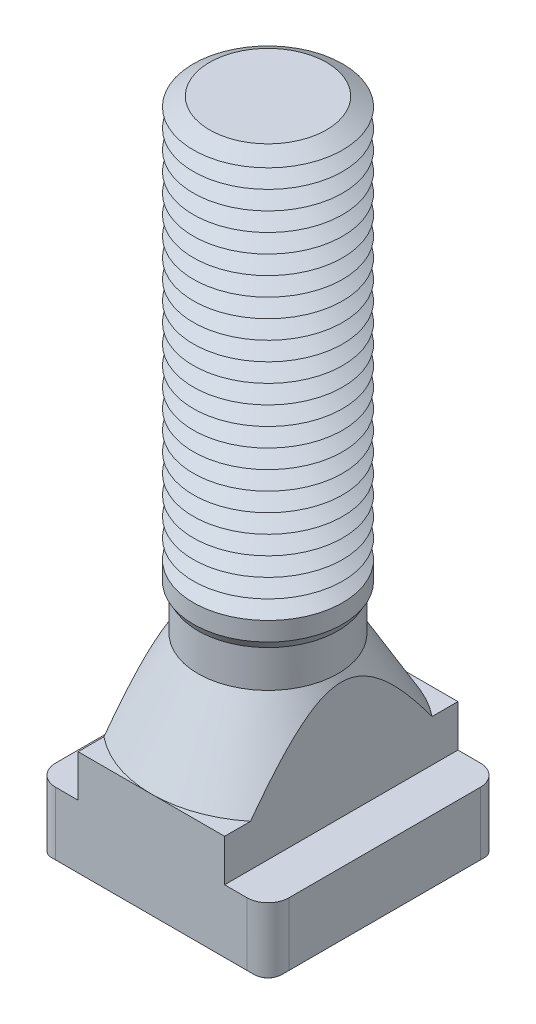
ISO-10303-21;
HEADER;
FILE_DESCRIPTION(('STEP AP214'),'2;1');
FILE_NAME('part.step','',(''),(''),'','','');
FILE_SCHEMA(('AUTOMOTIVE_DESIGN { 1 0 10303 214 1 1 1 1 }'));
ENDSEC;
DATA;
#1=APPLICATION_CONTEXT('core data for automotive mechanical design processes');
#2=APPLICATION_PROTOCOL_DEFINITION('international standard','automotive_design',2000,#1);
#3=PRODUCT_CONTEXT('',#1,'mechanical');
#4=PRODUCT('Part','Part','',(#3));
#5=PRODUCT_RELATED_PRODUCT_CATEGORY('part','',(#4));
#6=PRODUCT_DEFINITION_FORMATION('','',#4);
#7=PRODUCT_DEFINITION_CONTEXT('part definition',#1,'design');
#8=PRODUCT_DEFINITION('design','',#6,#7);
#9=PRODUCT_DEFINITION_SHAPE('','',#8);
#10=(LENGTH_UNIT() NAMED_UNIT(*) SI_UNIT(.MILLI.,.METRE.));
#11=(NAMED_UNIT(*) PLANE_ANGLE_UNIT() SI_UNIT($,.RADIAN.));
#12=(NAMED_UNIT(*) SI_UNIT($,.STERADIAN.) SOLID_ANGLE_UNIT());
#13=UNCERTAINTY_MEASURE_WITH_UNIT(LENGTH_MEASURE(1.E-05),#10,'distance_accuracy_value','');
#14=(GEOMETRIC_REPRESENTATION_CONTEXT(3) GLOBAL_UNCERTAINTY_ASSIGNED_CONTEXT((#13)) GLOBAL_UNIT_ASSIGNED_CONTEXT((#10,
#11,#12)) REPRESENTATION_CONTEXT('',''));
#15=CARTESIAN_POINT('',(0.,0.,0.));
#16=DIRECTION('',(0.,0.,1.));
#17=DIRECTION('',(1.,0.,0.));
#18=AXIS2_PLACEMENT_3D('',#15,#16,#17);
#19=CARTESIAN_POINT('',(0.,64.,0.));
#20=DIRECTION('',(0.,-1.,0.));
#21=DIRECTION('',(0.,0.,-1.));
#22=AXIS2_PLACEMENT_3D('',#19,#20,#21);
#23=CONICAL_SURFACE('',#22,6.26794919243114,1.0471975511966);
#24=CARTESIAN_POINT('',(0.,63.,0.));
#25=DIRECTION('',(0.,-1.,0.));
#26=DIRECTION('',(0.,0.,-1.));
#27=AXIS2_PLACEMENT_3D('',#24,#25,#26);
#28=CIRCLE('',#27,8.00000000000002);
#29=CARTESIAN_POINT('',(0.,63.,-8.00000000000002));
#30=VERTEX_POINT('',#29);
#31=EDGE_CURVE('E652',#30,#30,#28,.T.);
#32=ORIENTED_EDGE('',*,*,#31,.F.);
#33=EDGE_LOOP('',(#32));
#34=FACE_BOUND('',#33,.T.);
#35=CARTESIAN_POINT('',(0.,64.,0.));
#36=DIRECTION('',(0.,-1.,0.));
#37=DIRECTION('',(0.,0.,-1.));
#38=AXIS2_PLACEMENT_3D('',#35,#36,#37);
#39=CIRCLE('',#38,6.26794919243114);
#40=CARTESIAN_POINT('',(0.,64.,-6.26794919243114));
#41=VERTEX_POINT('',#40);
#42=EDGE_CURVE('E731',#41,#41,#39,.T.);
#43=ORIENTED_EDGE('',*,*,#42,.T.);
#44=EDGE_LOOP('',(#43));
#45=FACE_BOUND('',#44,.T.);
#46=ADVANCED_FACE('F39',(#34,#45),#23,.T.);
#47=CARTESIAN_POINT('',(0.,65.,0.));
#48=DIRECTION('',(0.,1.,0.));
#49=DIRECTION('',(0.,0.,1.));
#50=AXIS2_PLACEMENT_3D('',#47,#48,#49);
#51=CONICAL_SURFACE('',#50,8.00000000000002,1.0471975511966);
#52=ORIENTED_EDGE('',*,*,#42,.F.);
#53=EDGE_LOOP('',(#52));
#54=FACE_BOUND('',#53,.T.);
#55=CARTESIAN_POINT('',(0.,65.,0.));
#56=DIRECTION('',(0.,-1.,0.));
#57=DIRECTION('',(0.,0.,-1.));
#58=AXIS2_PLACEMENT_3D('',#55,#56,#57);
#59=CIRCLE('',#58,8.00000000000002);
#60=CARTESIAN_POINT('',(0.,65.,-8.00000000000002));
#61=VERTEX_POINT('',#60);
#62=EDGE_CURVE('E735',#61,#61,#59,.T.);
#63=ORIENTED_EDGE('',*,*,#62,.T.);
#64=EDGE_LOOP('',(#63));
#65=FACE_BOUND('',#64,.T.);
#66=ADVANCED_FACE('F448',(#54,#65),#51,.T.);
#67=CARTESIAN_POINT('',(3.94847322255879,72.,0.));
#68=DIRECTION('',(0.,-1.,0.));
#69=DIRECTION('',(1.,0.,0.));
#70=AXIS2_PLACEMENT_3D('',#67,#68,#69);
#71=PLANE('',#70);
#72=CARTESIAN_POINT('',(0.,72.,0.));
#73=DIRECTION('',(0.,-1.,0.));
#74=DIRECTION('',(0.,0.,-1.));
#75=AXIS2_PLACEMENT_3D('',#72,#73,#74);
#76=CIRCLE('',#75,6.26794919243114);
#77=CARTESIAN_POINT('',(0.,72.,-6.26794919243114));
#78=VERTEX_POINT('',#77);
#79=EDGE_CURVE('E679',#78,#78,#76,.T.);
#80=ORIENTED_EDGE('',*,*,#79,.F.);
#81=EDGE_LOOP('',(#80));
#82=FACE_BOUND('',#81,.T.);
#83=ADVANCED_FACE('F454',(#82),#71,.F.);
#84=CARTESIAN_POINT('',(0.,72.,0.));
#85=DIRECTION('',(0.,-1.,0.));
#86=DIRECTION('',(0.,0.,-1.));
#87=AXIS2_PLACEMENT_3D('',#84,#85,#86);
#88=CONICAL_SURFACE('',#87,6.26794919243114,1.0471975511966);
#89=CARTESIAN_POINT('',(0.,71.,0.));
#90=DIRECTION('',(0.,-1.,0.));
#91=DIRECTION('',(0.,0.,-1.));
#92=AXIS2_PLACEMENT_3D('',#89,#90,#91);
#93=CIRCLE('',#92,8.00000000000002);
#94=CARTESIAN_POINT('',(0.,71.,-8.00000000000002));
#95=VERTEX_POINT('',#94);
#96=EDGE_CURVE('E672',#95,#95,#93,.T.);
#97=ORIENTED_EDGE('',*,*,#96,.F.);
#98=EDGE_LOOP('',(#97));
#99=FACE_BOUND('',#98,.T.);
#100=ORIENTED_EDGE('',*,*,#79,.T.);
#101=EDGE_LOOP('',(#100));
#102=FACE_BOUND('',#101,.T.);
#103=ADVANCED_FACE('F482',(#99,#102),#88,.T.);
#104=CARTESIAN_POINT('',(0.,71.,0.));
#105=DIRECTION('',(0.,1.,0.));
#106=DIRECTION('',(0.,0.,1.));
#107=AXIS2_PLACEMENT_3D('',#104,#105,#106);
#108=CONICAL_SURFACE('',#107,8.00000000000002,1.0471975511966);
#109=CARTESIAN_POINT('',(0.,70.,0.));
#110=DIRECTION('',(0.,-1.,0.));
#111=DIRECTION('',(0.,0.,-1.));
#112=AXIS2_PLACEMENT_3D('',#109,#110,#111);
#113=CIRCLE('',#112,6.26794919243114);
#114=CARTESIAN_POINT('',(0.,70.,-6.26794919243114));
#115=VERTEX_POINT('',#114);
#116=EDGE_CURVE('E670',#115,#115,#113,.T.);
#117=ORIENTED_EDGE('',*,*,#116,.F.);
#118=EDGE_LOOP('',(#117));
#119=FACE_BOUND('',#118,.T.);
#120=ORIENTED_EDGE('',*,*,#96,.T.);
#121=EDGE_LOOP('',(#120));
#122=FACE_BOUND('',#121,.T.);
#123=ADVANCED_FACE('F479',(#119,#122),#108,.T.);
#124=CARTESIAN_POINT('',(0.,70.,0.));
#125=DIRECTION('',(0.,-1.,0.));
#126=DIRECTION('',(0.,0.,-1.));
#127=AXIS2_PLACEMENT_3D('',#124,#125,#126);
#128=CONICAL_SURFACE('',#127,6.26794919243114,1.0471975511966);
#129=CARTESIAN_POINT('',(0.,69.,0.));
#130=DIRECTION('',(0.,-1.,0.));
#131=DIRECTION('',(0.,0.,-1.));
#132=AXIS2_PLACEMENT_3D('',#129,#130,#131);
#133=CIRCLE('',#132,8.00000000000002);
#134=CARTESIAN_POINT('',(0.,69.,-8.00000000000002));
#135=VERTEX_POINT('',#134);
#136=EDGE_CURVE('E673',#135,#135,#133,.T.);
#137=ORIENTED_EDGE('',*,*,#136,.F.);
#138=EDGE_LOOP('',(#137));
#139=FACE_BOUND('',#138,.T.);
#140=ORIENTED_EDGE('',*,*,#116,.T.);
#141=EDGE_LOOP('',(#140));
#142=FACE_BOUND('',#141,.T.);
#143=ADVANCED_FACE('F474',(#139,#142),#128,.T.);
#144=CARTESIAN_POINT('',(0.,69.,0.));
#145=DIRECTION('',(0.,1.,0.));
#146=DIRECTION('',(0.,0.,1.));
#147=AXIS2_PLACEMENT_3D('',#144,#145,#146);
#148=CONICAL_SURFACE('',#147,8.00000000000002,1.0471975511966);
#149=CARTESIAN_POINT('',(0.,68.,0.));
#150=DIRECTION('',(0.,-1.,0.));
#151=DIRECTION('',(0.,0.,-1.));
#152=AXIS2_PLACEMENT_3D('',#149,#150,#151);
#153=CIRCLE('',#152,6.26794919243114);
#154=CARTESIAN_POINT('',(0.,68.,-6.26794919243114));
#155=VERTEX_POINT('',#154);
#156=EDGE_CURVE('E683',#155,#155,#153,.T.);
#157=ORIENTED_EDGE('',*,*,#156,.F.);
#158=EDGE_LOOP('',(#157));
#159=FACE_BOUND('',#158,.T.);
#160=ORIENTED_EDGE('',*,*,#136,.T.);
#161=EDGE_LOOP('',(#160));
#162=FACE_BOUND('',#161,.T.);
#163=ADVANCED_FACE('F471',(#159,#162),#148,.T.);
#164=CARTESIAN_POINT('',(0.,68.,0.));
#165=DIRECTION('',(0.,-1.,0.));
#166=DIRECTION('',(0.,0.,-1.));
#167=AXIS2_PLACEMENT_3D('',#164,#165,#166);
#168=CONICAL_SURFACE('',#167,6.26794919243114,1.0471975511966);
#169=CARTESIAN_POINT('',(0.,67.,0.));
#170=DIRECTION('',(0.,-1.,0.));
#171=DIRECTION('',(0.,0.,-1.));
#172=AXIS2_PLACEMENT_3D('',#169,#170,#171);
#173=CIRCLE('',#172,8.00000000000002);
#174=CARTESIAN_POINT('',(0.,67.,-8.00000000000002));
#175=VERTEX_POINT('',#174);
#176=EDGE_CURVE('E743',#175,#175,#173,.T.);
#177=ORIENTED_EDGE('',*,*,#176,.F.);
#178=EDGE_LOOP('',(#177));
#179=FACE_BOUND('',#178,.T.);
#180=ORIENTED_EDGE('',*,*,#156,.T.);
#181=EDGE_LOOP('',(#180));
#182=FACE_BOUND('',#181,.T.);
#183=ADVANCED_FACE('F465',(#179,#182),#168,.T.);
#184=CARTESIAN_POINT('',(0.,67.,0.));
#185=DIRECTION('',(0.,1.,0.));
#186=DIRECTION('',(0.,0.,1.));
#187=AXIS2_PLACEMENT_3D('',#184,#185,#186);
#188=CONICAL_SURFACE('',#187,8.00000000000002,1.0471975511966);
#189=CARTESIAN_POINT('',(0.,66.,0.));
#190=DIRECTION('',(0.,-1.,0.));
#191=DIRECTION('',(0.,0.,-1.));
#192=AXIS2_PLACEMENT_3D('',#189,#190,#191);
#193=CIRCLE('',#192,6.26794919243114);
#194=CARTESIAN_POINT('',(0.,66.,-6.26794919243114));
#195=VERTEX_POINT('',#194);
#196=EDGE_CURVE('E739',#195,#195,#193,.T.);
#197=ORIENTED_EDGE('',*,*,#196,.F.);
#198=EDGE_LOOP('',(#197));
#199=FACE_BOUND('',#198,.T.);
#200=ORIENTED_EDGE('',*,*,#176,.T.);
#201=EDGE_LOOP('',(#200));
#202=FACE_BOUND('',#201,.T.);
#203=ADVANCED_FACE('F461',(#199,#202),#188,.T.);
#204=CARTESIAN_POINT('',(0.,66.,0.));
#205=DIRECTION('',(0.,-1.,0.));
#206=DIRECTION('',(0.,0.,-1.));
#207=AXIS2_PLACEMENT_3D('',#204,#205,#206);
#208=CONICAL_SURFACE('',#207,6.26794919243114,1.0471975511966);
#209=ORIENTED_EDGE('',*,*,#62,.F.);
#210=EDGE_LOOP('',(#209));
#211=FACE_BOUND('',#210,.T.);
#212=ORIENTED_EDGE('',*,*,#196,.T.);
#213=EDGE_LOOP('',(#212));
#214=FACE_BOUND('',#213,.T.);
#215=ADVANCED_FACE('F464',(#211,#214),#208,.T.);
#216=CARTESIAN_POINT('',(0.,62.,0.));
#217=DIRECTION('',(0.,-1.,0.));
#218=DIRECTION('',(0.,0.,-1.));
#219=AXIS2_PLACEMENT_3D('',#216,#217,#218);
#220=CONICAL_SURFACE('',#219,6.26794919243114,1.0471975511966);
#221=CARTESIAN_POINT('',(0.,61.,0.));
#222=DIRECTION('',(0.,-1.,0.));
#223=DIRECTION('',(0.,0.,-1.));
#224=AXIS2_PLACEMENT_3D('',#221,#222,#223);
#225=CIRCLE('',#224,8.00000000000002);
#226=CARTESIAN_POINT('',(0.,61.,-8.00000000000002));
#227=VERTEX_POINT('',#226);
#228=EDGE_CURVE('E653',#227,#227,#225,.T.);
#229=ORIENTED_EDGE('',*,*,#228,.F.);
#230=EDGE_LOOP('',(#229));
#231=FACE_BOUND('',#230,.T.);
#232=CARTESIAN_POINT('',(0.,62.,0.));
#233=DIRECTION('',(0.,-1.,0.));
#234=DIRECTION('',(0.,0.,-1.));
#235=AXIS2_PLACEMENT_3D('',#232,#233,#234);
#236=CIRCLE('',#235,6.26794919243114);
#237=CARTESIAN_POINT('',(0.,62.,-6.26794919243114));
#238=VERTEX_POINT('',#237);
#239=EDGE_CURVE('E650',#238,#238,#236,.T.);
#240=ORIENTED_EDGE('',*,*,#239,.T.);
#241=EDGE_LOOP('',(#240));
#242=FACE_BOUND('',#241,.T.);
#243=ADVANCED_FACE('F469',(#231,#242),#220,.T.);
#244=CARTESIAN_POINT('',(0.,63.,0.));
#245=DIRECTION('',(0.,1.,0.));
#246=DIRECTION('',(0.,0.,1.));
#247=AXIS2_PLACEMENT_3D('',#244,#245,#246);
#248=CONICAL_SURFACE('',#247,8.00000000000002,1.0471975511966);
#249=ORIENTED_EDGE('',*,*,#239,.F.);
#250=EDGE_LOOP('',(#249));
#251=FACE_BOUND('',#250,.T.);
#252=ORIENTED_EDGE('',*,*,#31,.T.);
#253=EDGE_LOOP('',(#252));
#254=FACE_BOUND('',#253,.T.);
#255=ADVANCED_FACE('F803',(#251,#254),#248,.T.);
#256=CARTESIAN_POINT('',(0.,60.,0.));
#257=DIRECTION('',(0.,-1.,0.));
#258=DIRECTION('',(0.,0.,-1.));
#259=AXIS2_PLACEMENT_3D('',#256,#257,#258);
#260=CONICAL_SURFACE('',#259,6.26794919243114,1.0471975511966);
#261=CARTESIAN_POINT('',(0.,59.,0.));
#262=DIRECTION('',(0.,-1.,0.));
#263=DIRECTION('',(0.,0.,-1.));
#264=AXIS2_PLACEMENT_3D('',#261,#262,#263);
#265=CIRCLE('',#264,8.00000000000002);
#266=CARTESIAN_POINT('',(0.,59.,-8.00000000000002));
#267=VERTEX_POINT('',#266);
#268=EDGE_CURVE('E715',#267,#267,#265,.T.);
#269=ORIENTED_EDGE('',*,*,#268,.F.);
#270=EDGE_LOOP('',(#269));
#271=FACE_BOUND('',#270,.T.);
#272=CARTESIAN_POINT('',(0.,60.,0.));
#273=DIRECTION('',(0.,-1.,0.));
#274=DIRECTION('',(0.,0.,-1.));
#275=AXIS2_PLACEMENT_3D('',#272,#273,#274);
#276=CIRCLE('',#275,6.26794919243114);
#277=CARTESIAN_POINT('',(0.,60.,-6.26794919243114));
#278=VERTEX_POINT('',#277);
#279=EDGE_CURVE('E713',#278,#278,#276,.T.);
#280=ORIENTED_EDGE('',*,*,#279,.T.);
#281=EDGE_LOOP('',(#280));
#282=FACE_BOUND('',#281,.T.);
#283=ADVANCED_FACE('F800',(#271,#282),#260,.T.);
#284=CARTESIAN_POINT('',(0.,61.,0.));
#285=DIRECTION('',(0.,1.,0.));
#286=DIRECTION('',(0.,0.,1.));
#287=AXIS2_PLACEMENT_3D('',#284,#285,#286);
#288=CONICAL_SURFACE('',#287,8.00000000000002,1.0471975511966);
#289=ORIENTED_EDGE('',*,*,#279,.F.);
#290=EDGE_LOOP('',(#289));
#291=FACE_BOUND('',#290,.T.);
#292=ORIENTED_EDGE('',*,*,#228,.T.);
#293=EDGE_LOOP('',(#292));
#294=FACE_BOUND('',#293,.T.);
#295=ADVANCED_FACE('F802',(#291,#294),#288,.T.);
#296=CARTESIAN_POINT('',(0.,58.,0.));
#297=DIRECTION('',(0.,-1.,0.));
#298=DIRECTION('',(0.,0.,-1.));
#299=AXIS2_PLACEMENT_3D('',#296,#297,#298);
#300=CONICAL_SURFACE('',#299,6.26794919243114,1.0471975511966);
#301=CARTESIAN_POINT('',(0.,57.,0.));
#302=DIRECTION('',(0.,-1.,0.));
#303=DIRECTION('',(0.,0.,-1.));
#304=AXIS2_PLACEMENT_3D('',#301,#302,#303);
#305=CIRCLE('',#304,8.00000000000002);
#306=CARTESIAN_POINT('',(0.,57.,-8.00000000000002));
#307=VERTEX_POINT('',#306);
#308=EDGE_CURVE('E784',#307,#307,#305,.T.);
#309=ORIENTED_EDGE('',*,*,#308,.F.);
#310=EDGE_LOOP('',(#309));
#311=FACE_BOUND('',#310,.T.);
#312=CARTESIAN_POINT('',(0.,58.,0.));
#313=DIRECTION('',(0.,-1.,0.));
#314=DIRECTION('',(0.,0.,-1.));
#315=AXIS2_PLACEMENT_3D('',#312,#313,#314);
#316=CIRCLE('',#315,6.26794919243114);
#317=CARTESIAN_POINT('',(0.,58.,-6.26794919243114));
#318=VERTEX_POINT('',#317);
#319=EDGE_CURVE('E724',#318,#318,#316,.T.);
#320=ORIENTED_EDGE('',*,*,#319,.T.);
#321=EDGE_LOOP('',(#320));
#322=FACE_BOUND('',#321,.T.);
#323=ADVANCED_FACE('F791',(#311,#322),#300,.T.);
#324=CARTESIAN_POINT('',(0.,59.,0.));
#325=DIRECTION('',(0.,1.,0.));
#326=DIRECTION('',(0.,0.,1.));
#327=AXIS2_PLACEMENT_3D('',#324,#325,#326);
#328=CONICAL_SURFACE('',#327,8.00000000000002,1.0471975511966);
#329=ORIENTED_EDGE('',*,*,#319,.F.);
#330=EDGE_LOOP('',(#329));
#331=FACE_BOUND('',#330,.T.);
#332=ORIENTED_EDGE('',*,*,#268,.T.);
#333=EDGE_LOOP('',(#332));
#334=FACE_BOUND('',#333,.T.);
#335=ADVANCED_FACE('F793',(#331,#334),#328,.T.);
#336=CARTESIAN_POINT('',(0.,56.,0.));
#337=DIRECTION('',(0.,-1.,0.));
#338=DIRECTION('',(0.,0.,-1.));
#339=AXIS2_PLACEMENT_3D('',#336,#337,#338);
#340=CONICAL_SURFACE('',#339,6.26794919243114,1.0471975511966);
#341=CARTESIAN_POINT('',(0.,55.,0.));
#342=DIRECTION('',(0.,-1.,0.));
#343=DIRECTION('',(0.,0.,-1.));
#344=AXIS2_PLACEMENT_3D('',#341,#342,#343);
#345=CIRCLE('',#344,8.00000000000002);
#346=CARTESIAN_POINT('',(0.,55.,-8.00000000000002));
#347=VERTEX_POINT('',#346);
#348=EDGE_CURVE('E644',#347,#347,#345,.T.);
#349=ORIENTED_EDGE('',*,*,#348,.F.);
#350=EDGE_LOOP('',(#349));
#351=FACE_BOUND('',#350,.T.);
#352=CARTESIAN_POINT('',(0.,56.,0.));
#353=DIRECTION('',(0.,-1.,0.));
#354=DIRECTION('',(0.,0.,-1.));
#355=AXIS2_PLACEMENT_3D('',#352,#353,#354);
#356=CIRCLE('',#355,6.26794919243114);
#357=CARTESIAN_POINT('',(0.,56.,-6.26794919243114));
#358=VERTEX_POINT('',#357);
#359=EDGE_CURVE('E647',#358,#358,#356,.T.);
#360=ORIENTED_EDGE('',*,*,#359,.T.);
#361=EDGE_LOOP('',(#360));
#362=FACE_BOUND('',#361,.T.);
#363=ADVANCED_FACE('F796',(#351,#362),#340,.T.);
#364=CARTESIAN_POINT('',(0.,57.,0.));
#365=DIRECTION('',(0.,1.,0.));
#366=DIRECTION('',(0.,0.,1.));
#367=AXIS2_PLACEMENT_3D('',#364,#365,#366);
#368=CONICAL_SURFACE('',#367,8.00000000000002,1.0471975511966);
#369=ORIENTED_EDGE('',*,*,#359,.F.);
#370=EDGE_LOOP('',(#369));
#371=FACE_BOUND('',#370,.T.);
#372=ORIENTED_EDGE('',*,*,#308,.T.);
#373=EDGE_LOOP('',(#372));
#374=FACE_BOUND('',#373,.T.);
#375=ADVANCED_FACE('F855',(#371,#374),#368,.T.);
#376=CARTESIAN_POINT('',(0.,54.,0.));
#377=DIRECTION('',(0.,-1.,0.));
#378=DIRECTION('',(0.,0.,-1.));
#379=AXIS2_PLACEMENT_3D('',#376,#377,#378);
#380=CONICAL_SURFACE('',#379,6.26794919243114,1.0471975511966);
#381=CARTESIAN_POINT('',(0.,53.,0.));
#382=DIRECTION('',(0.,-1.,0.));
#383=DIRECTION('',(0.,0.,-1.));
#384=AXIS2_PLACEMENT_3D('',#381,#382,#383);
#385=CIRCLE('',#384,8.00000000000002);
#386=CARTESIAN_POINT('',(0.,53.,-8.00000000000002));
#387=VERTEX_POINT('',#386);
#388=EDGE_CURVE('E767',#387,#387,#385,.T.);
#389=ORIENTED_EDGE('',*,*,#388,.F.);
#390=EDGE_LOOP('',(#389));
#391=FACE_BOUND('',#390,.T.);
#392=CARTESIAN_POINT('',(0.,54.,0.));
#393=DIRECTION('',(0.,-1.,0.));
#394=DIRECTION('',(0.,0.,-1.));
#395=AXIS2_PLACEMENT_3D('',#392,#393,#394);
#396=CIRCLE('',#395,6.26794919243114);
#397=CARTESIAN_POINT('',(0.,54.,-6.26794919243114));
#398=VERTEX_POINT('',#397);
#399=EDGE_CURVE('E648',#398,#398,#396,.T.);
#400=ORIENTED_EDGE('',*,*,#399,.T.);
#401=EDGE_LOOP('',(#400));
#402=FACE_BOUND('',#401,.T.);
#403=ADVANCED_FACE('F864',(#391,#402),#380,.T.);
#404=CARTESIAN_POINT('',(0.,55.,0.));
#405=DIRECTION('',(0.,1.,0.));
#406=DIRECTION('',(0.,0.,1.));
#407=AXIS2_PLACEMENT_3D('',#404,#405,#406);
#408=CONICAL_SURFACE('',#407,8.00000000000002,1.0471975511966);
#409=ORIENTED_EDGE('',*,*,#399,.F.);
#410=EDGE_LOOP('',(#409));
#411=FACE_BOUND('',#410,.T.);
#412=ORIENTED_EDGE('',*,*,#348,.T.);
#413=EDGE_LOOP('',(#412));
#414=FACE_BOUND('',#413,.T.);
#415=ADVANCED_FACE('F873',(#411,#414),#408,.T.);
#416=CARTESIAN_POINT('',(0.,52.,0.));
#417=DIRECTION('',(0.,-1.,0.));
#418=DIRECTION('',(0.,0.,-1.));
#419=AXIS2_PLACEMENT_3D('',#416,#417,#418);
#420=CONICAL_SURFACE('',#419,6.26794919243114,1.0471975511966);
#421=CARTESIAN_POINT('',(0.,51.,0.));
#422=DIRECTION('',(0.,-1.,0.));
#423=DIRECTION('',(0.,0.,-1.));
#424=AXIS2_PLACEMENT_3D('',#421,#422,#423);
#425=CIRCLE('',#424,8.00000000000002);
#426=CARTESIAN_POINT('',(0.,51.,-8.00000000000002));
#427=VERTEX_POINT('',#426);
#428=EDGE_CURVE('E641',#427,#427,#425,.T.);
#429=ORIENTED_EDGE('',*,*,#428,.F.);
#430=EDGE_LOOP('',(#429));
#431=FACE_BOUND('',#430,.T.);
#432=CARTESIAN_POINT('',(0.,52.,0.));
#433=DIRECTION('',(0.,-1.,0.));
#434=DIRECTION('',(0.,0.,-1.));
#435=AXIS2_PLACEMENT_3D('',#432,#433,#434);
#436=CIRCLE('',#435,6.26794919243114);
#437=CARTESIAN_POINT('',(0.,52.,-6.26794919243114));
#438=VERTEX_POINT('',#437);
#439=EDGE_CURVE('E769',#438,#438,#436,.T.);
#440=ORIENTED_EDGE('',*,*,#439,.T.);
#441=EDGE_LOOP('',(#440));
#442=FACE_BOUND('',#441,.T.);
#443=ADVANCED_FACE('F882',(#431,#442),#420,.T.);
#444=CARTESIAN_POINT('',(0.,53.,0.));
#445=DIRECTION('',(0.,1.,0.));
#446=DIRECTION('',(0.,0.,1.));
#447=AXIS2_PLACEMENT_3D('',#444,#445,#446);
#448=CONICAL_SURFACE('',#447,8.00000000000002,1.0471975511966);
#449=ORIENTED_EDGE('',*,*,#439,.F.);
#450=EDGE_LOOP('',(#449));
#451=FACE_BOUND('',#450,.T.);
#452=ORIENTED_EDGE('',*,*,#388,.T.);
#453=EDGE_LOOP('',(#452));
#454=FACE_BOUND('',#453,.T.);
#455=ADVANCED_FACE('F891',(#451,#454),#448,.T.);
#456=CARTESIAN_POINT('',(0.,50.,0.));
#457=DIRECTION('',(0.,-1.,0.));
#458=DIRECTION('',(0.,0.,-1.));
#459=AXIS2_PLACEMENT_3D('',#456,#457,#458);
#460=CONICAL_SURFACE('',#459,6.26794919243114,1.0471975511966);
#461=CARTESIAN_POINT('',(0.,49.,0.));
#462=DIRECTION('',(0.,-1.,0.));
#463=DIRECTION('',(0.,0.,-1.));
#464=AXIS2_PLACEMENT_3D('',#461,#462,#463);
#465=CIRCLE('',#464,8.00000000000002);
#466=CARTESIAN_POINT('',(0.,49.,-8.00000000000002));
#467=VERTEX_POINT('',#466);
#468=EDGE_CURVE('E642',#467,#467,#465,.T.);
#469=ORIENTED_EDGE('',*,*,#468,.F.);
#470=EDGE_LOOP('',(#469));
#471=FACE_BOUND('',#470,.T.);
#472=CARTESIAN_POINT('',(0.,50.,0.));
#473=DIRECTION('',(0.,-1.,0.));
#474=DIRECTION('',(0.,0.,-1.));
#475=AXIS2_PLACEMENT_3D('',#472,#473,#474);
#476=CIRCLE('',#475,6.26794919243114);
#477=CARTESIAN_POINT('',(0.,50.,-6.26794919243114));
#478=VERTEX_POINT('',#477);
#479=EDGE_CURVE('E638',#478,#478,#476,.T.);
#480=ORIENTED_EDGE('',*,*,#479,.T.);
#481=EDGE_LOOP('',(#480));
#482=FACE_BOUND('',#481,.T.);
#483=ADVANCED_FACE('F900',(#471,#482),#460,.T.);
#484=CARTESIAN_POINT('',(0.,51.,0.));
#485=DIRECTION('',(0.,1.,0.));
#486=DIRECTION('',(0.,0.,1.));
#487=AXIS2_PLACEMENT_3D('',#484,#485,#486);
#488=CONICAL_SURFACE('',#487,8.00000000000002,1.0471975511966);
#489=ORIENTED_EDGE('',*,*,#479,.F.);
#490=EDGE_LOOP('',(#489));
#491=FACE_BOUND('',#490,.T.);
#492=ORIENTED_EDGE('',*,*,#428,.T.);
#493=EDGE_LOOP('',(#492));
#494=FACE_BOUND('',#493,.T.);
#495=ADVANCED_FACE('F909',(#491,#494),#488,.T.);
#496=CARTESIAN_POINT('',(0.,48.,0.));
#497=DIRECTION('',(0.,-1.,0.));
#498=DIRECTION('',(0.,0.,-1.));
#499=AXIS2_PLACEMENT_3D('',#496,#497,#498);
#500=CONICAL_SURFACE('',#499,6.26794919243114,1.0471975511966);
#501=CARTESIAN_POINT('',(0.,47.,0.));
#502=DIRECTION('',(0.,-1.,0.));
#503=DIRECTION('',(0.,0.,-1.));
#504=AXIS2_PLACEMENT_3D('',#501,#502,#503);
#505=CIRCLE('',#504,8.00000000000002);
#506=CARTESIAN_POINT('',(0.,47.,-8.00000000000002));
#507=VERTEX_POINT('',#506);
#508=EDGE_CURVE('E668',#507,#507,#505,.T.);
#509=ORIENTED_EDGE('',*,*,#508,.F.);
#510=EDGE_LOOP('',(#509));
#511=FACE_BOUND('',#510,.T.);
#512=CARTESIAN_POINT('',(0.,48.,0.));
#513=DIRECTION('',(0.,-1.,0.));
#514=DIRECTION('',(0.,0.,-1.));
#515=AXIS2_PLACEMENT_3D('',#512,#513,#514);
#516=CIRCLE('',#515,6.26794919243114);
#517=CARTESIAN_POINT('',(0.,48.,-6.26794919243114));
#518=VERTEX_POINT('',#517);
#519=EDGE_CURVE('E665',#518,#518,#516,.T.);
#520=ORIENTED_EDGE('',*,*,#519,.T.);
#521=EDGE_LOOP('',(#520));
#522=FACE_BOUND('',#521,.T.);
#523=ADVANCED_FACE('F918',(#511,#522),#500,.T.);
#524=CARTESIAN_POINT('',(0.,49.,0.));
#525=DIRECTION('',(0.,1.,0.));
#526=DIRECTION('',(0.,0.,1.));
#527=AXIS2_PLACEMENT_3D('',#524,#525,#526);
#528=CONICAL_SURFACE('',#527,8.00000000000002,1.0471975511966);
#529=ORIENTED_EDGE('',*,*,#519,.F.);
#530=EDGE_LOOP('',(#529));
#531=FACE_BOUND('',#530,.T.);
#532=ORIENTED_EDGE('',*,*,#468,.T.);
#533=EDGE_LOOP('',(#532));
#534=FACE_BOUND('',#533,.T.);
#535=ADVANCED_FACE('F927',(#531,#534),#528,.T.);
#536=CARTESIAN_POINT('',(0.,46.,0.));
#537=DIRECTION('',(0.,-1.,0.));
#538=DIRECTION('',(0.,0.,-1.));
#539=AXIS2_PLACEMENT_3D('',#536,#537,#538);
#540=CONICAL_SURFACE('',#539,6.26794919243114,1.0471975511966);
#541=CARTESIAN_POINT('',(0.,45.,0.));
#542=DIRECTION('',(0.,-1.,0.));
#543=DIRECTION('',(0.,0.,-1.));
#544=AXIS2_PLACEMENT_3D('',#541,#542,#543);
#545=CIRCLE('',#544,8.00000000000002);
#546=CARTESIAN_POINT('',(0.,45.,-8.00000000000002));
#547=VERTEX_POINT('',#546);
#548=EDGE_CURVE('E705',#547,#547,#545,.T.);
#549=ORIENTED_EDGE('',*,*,#548,.F.);
#550=EDGE_LOOP('',(#549));
#551=FACE_BOUND('',#550,.T.);
#552=CARTESIAN_POINT('',(0.,46.,0.));
#553=DIRECTION('',(0.,-1.,0.));
#554=DIRECTION('',(0.,0.,-1.));
#555=AXIS2_PLACEMENT_3D('',#552,#553,#554);
#556=CIRCLE('',#555,6.26794919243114);
#557=CARTESIAN_POINT('',(0.,46.,-6.26794919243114));
#558=VERTEX_POINT('',#557);
#559=EDGE_CURVE('E703',#558,#558,#556,.T.);
#560=ORIENTED_EDGE('',*,*,#559,.T.);
#561=EDGE_LOOP('',(#560));
#562=FACE_BOUND('',#561,.T.);
#563=ADVANCED_FACE('F936',(#551,#562),#540,.T.);
#564=CARTESIAN_POINT('',(0.,47.,0.));
#565=DIRECTION('',(0.,1.,0.));
#566=DIRECTION('',(0.,0.,1.));
#567=AXIS2_PLACEMENT_3D('',#564,#565,#566);
#568=CONICAL_SURFACE('',#567,8.00000000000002,1.0471975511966);
#569=ORIENTED_EDGE('',*,*,#559,.F.);
#570=EDGE_LOOP('',(#569));
#571=FACE_BOUND('',#570,.T.);
#572=ORIENTED_EDGE('',*,*,#508,.T.);
#573=EDGE_LOOP('',(#572));
#574=FACE_BOUND('',#573,.T.);
#575=ADVANCED_FACE('F945',(#571,#574),#568,.T.);
#576=CARTESIAN_POINT('',(0.,44.,0.));
#577=DIRECTION('',(0.,-1.,0.));
#578=DIRECTION('',(0.,0.,-1.));
#579=AXIS2_PLACEMENT_3D('',#576,#577,#578);
#580=CONICAL_SURFACE('',#579,6.26794919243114,1.0471975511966);
#581=CARTESIAN_POINT('',(0.,43.,0.));
#582=DIRECTION('',(0.,-1.,0.));
#583=DIRECTION('',(0.,0.,-1.));
#584=AXIS2_PLACEMENT_3D('',#581,#582,#583);
#585=CIRCLE('',#584,8.00000000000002);
#586=CARTESIAN_POINT('',(0.,43.,-8.00000000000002));
#587=VERTEX_POINT('',#586);
#588=EDGE_CURVE('E663',#587,#587,#585,.T.);
#589=ORIENTED_EDGE('',*,*,#588,.F.);
#590=EDGE_LOOP('',(#589));
#591=FACE_BOUND('',#590,.T.);
#592=CARTESIAN_POINT('',(0.,44.,0.));
#593=DIRECTION('',(0.,-1.,0.));
#594=DIRECTION('',(0.,0.,-1.));
#595=AXIS2_PLACEMENT_3D('',#592,#593,#594);
#596=CIRCLE('',#595,6.26794919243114);
#597=CARTESIAN_POINT('',(0.,44.,-6.26794919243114));
#598=VERTEX_POINT('',#597);
#599=EDGE_CURVE('E1455',#598,#598,#596,.T.);
#600=ORIENTED_EDGE('',*,*,#599,.T.);
#601=EDGE_LOOP('',(#600));
#602=FACE_BOUND('',#601,.T.);
#603=ADVANCED_FACE('F954',(#591,#602),#580,.T.);
#604=CARTESIAN_POINT('',(0.,45.,0.));
#605=DIRECTION('',(0.,1.,0.));
#606=DIRECTION('',(0.,0.,1.));
#607=AXIS2_PLACEMENT_3D('',#604,#605,#606);
#608=CONICAL_SURFACE('',#607,8.00000000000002,1.0471975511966);
#609=ORIENTED_EDGE('',*,*,#599,.F.);
#610=EDGE_LOOP('',(#609));
#611=FACE_BOUND('',#610,.T.);
#612=ORIENTED_EDGE('',*,*,#548,.T.);
#613=EDGE_LOOP('',(#612));
#614=FACE_BOUND('',#613,.T.);
#615=ADVANCED_FACE('F963',(#611,#614),#608,.T.);
#616=CARTESIAN_POINT('',(0.,42.,0.));
#617=DIRECTION('',(0.,-1.,0.));
#618=DIRECTION('',(0.,0.,-1.));
#619=AXIS2_PLACEMENT_3D('',#616,#617,#618);
#620=CONICAL_SURFACE('',#619,6.26794919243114,1.0471975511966);
#621=CARTESIAN_POINT('',(0.,41.,0.));
#622=DIRECTION('',(0.,-1.,0.));
#623=DIRECTION('',(0.,0.,-1.));
#624=AXIS2_PLACEMENT_3D('',#621,#622,#623);
#625=CIRCLE('',#624,8.00000000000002);
#626=CARTESIAN_POINT('',(0.,41.,-8.00000000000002));
#627=VERTEX_POINT('',#626);
#628=EDGE_CURVE('E632',#627,#627,#625,.T.);
#629=ORIENTED_EDGE('',*,*,#628,.F.);
#630=EDGE_LOOP('',(#629));
#631=FACE_BOUND('',#630,.T.);
#632=CARTESIAN_POINT('',(0.,42.,0.));
#633=DIRECTION('',(0.,-1.,0.));
#634=DIRECTION('',(0.,0.,-1.));
#635=AXIS2_PLACEMENT_3D('',#632,#633,#634);
#636=CIRCLE('',#635,6.26794919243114);
#637=CARTESIAN_POINT('',(0.,42.,-6.26794919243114));
#638=VERTEX_POINT('',#637);
#639=EDGE_CURVE('E635',#638,#638,#636,.T.);
#640=ORIENTED_EDGE('',*,*,#639,.T.);
#641=EDGE_LOOP('',(#640));
#642=FACE_BOUND('',#641,.T.);
#643=ADVANCED_FACE('F972',(#631,#642),#620,.T.);
#644=CARTESIAN_POINT('',(0.,43.,0.));
#645=DIRECTION('',(0.,1.,0.));
#646=DIRECTION('',(0.,0.,1.));
#647=AXIS2_PLACEMENT_3D('',#644,#645,#646);
#648=CONICAL_SURFACE('',#647,8.00000000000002,1.0471975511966);
#649=ORIENTED_EDGE('',*,*,#639,.F.);
#650=EDGE_LOOP('',(#649));
#651=FACE_BOUND('',#650,.T.);
#652=ORIENTED_EDGE('',*,*,#588,.T.);
#653=EDGE_LOOP('',(#652));
#654=FACE_BOUND('',#653,.T.);
#655=ADVANCED_FACE('F981',(#651,#654),#648,.T.);
#656=CARTESIAN_POINT('',(0.,40.,0.));
#657=DIRECTION('',(0.,-1.,0.));
#658=DIRECTION('',(0.,0.,-1.));
#659=AXIS2_PLACEMENT_3D('',#656,#657,#658);
#660=CONICAL_SURFACE('',#659,6.26794919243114,1.0471975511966);
#661=CARTESIAN_POINT('',(0.,39.,0.));
#662=DIRECTION('',(0.,-1.,0.));
#663=DIRECTION('',(0.,0.,-1.));
#664=AXIS2_PLACEMENT_3D('',#661,#662,#663);
#665=CIRCLE('',#664,8.00000000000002);
#666=CARTESIAN_POINT('',(0.,39.,-8.00000000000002));
#667=VERTEX_POINT('',#666);
#668=EDGE_CURVE('E656',#667,#667,#665,.T.);
#669=ORIENTED_EDGE('',*,*,#668,.F.);
#670=EDGE_LOOP('',(#669));
#671=FACE_BOUND('',#670,.T.);
#672=CARTESIAN_POINT('',(0.,40.,0.));
#673=DIRECTION('',(0.,-1.,0.));
#674=DIRECTION('',(0.,0.,-1.));
#675=AXIS2_PLACEMENT_3D('',#672,#673,#674);
#676=CIRCLE('',#675,6.26794919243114);
#677=CARTESIAN_POINT('',(0.,40.,-6.26794919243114));
#678=VERTEX_POINT('',#677);
#679=EDGE_CURVE('E636',#678,#678,#676,.T.);
#680=ORIENTED_EDGE('',*,*,#679,.T.);
#681=EDGE_LOOP('',(#680));
#682=FACE_BOUND('',#681,.T.);
#683=ADVANCED_FACE('F990',(#671,#682),#660,.T.);
#684=CARTESIAN_POINT('',(0.,41.,0.));
#685=DIRECTION('',(0.,1.,0.));
#686=DIRECTION('',(0.,0.,1.));
#687=AXIS2_PLACEMENT_3D('',#684,#685,#686);
#688=CONICAL_SURFACE('',#687,8.00000000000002,1.0471975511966);
#689=ORIENTED_EDGE('',*,*,#679,.F.);
#690=EDGE_LOOP('',(#689));
#691=FACE_BOUND('',#690,.T.);
#692=ORIENTED_EDGE('',*,*,#628,.T.);
#693=EDGE_LOOP('',(#692));
#694=FACE_BOUND('',#693,.T.);
#695=ADVANCED_FACE('F999',(#691,#694),#688,.T.);
#696=CARTESIAN_POINT('',(0.,38.,0.));
#697=DIRECTION('',(0.,-1.,0.));
#698=DIRECTION('',(0.,0.,-1.));
#699=AXIS2_PLACEMENT_3D('',#696,#697,#698);
#700=CONICAL_SURFACE('',#699,6.26794919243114,1.0471975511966);
#701=CARTESIAN_POINT('',(0.,37.,0.));
#702=DIRECTION('',(0.,-1.,0.));
#703=DIRECTION('',(0.,0.,-1.));
#704=AXIS2_PLACEMENT_3D('',#701,#702,#703);
#705=CIRCLE('',#704,8.00000000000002);
#706=CARTESIAN_POINT('',(0.,37.,-8.00000000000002));
#707=VERTEX_POINT('',#706);
#708=EDGE_CURVE('E773',#707,#707,#705,.T.);
#709=ORIENTED_EDGE('',*,*,#708,.F.);
#710=EDGE_LOOP('',(#709));
#711=FACE_BOUND('',#710,.T.);
#712=CARTESIAN_POINT('',(0.,38.,0.));
#713=DIRECTION('',(0.,-1.,0.));
#714=DIRECTION('',(0.,0.,-1.));
#715=AXIS2_PLACEMENT_3D('',#712,#713,#714);
#716=CIRCLE('',#715,6.26794919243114);
#717=CARTESIAN_POINT('',(0.,38.,-6.26794919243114));
#718=VERTEX_POINT('',#717);
#719=EDGE_CURVE('E659',#718,#718,#716,.T.);
#720=ORIENTED_EDGE('',*,*,#719,.T.);
#721=EDGE_LOOP('',(#720));
#722=FACE_BOUND('',#721,.T.);
#723=ADVANCED_FACE('F1008',(#711,#722),#700,.T.);
#724=CARTESIAN_POINT('',(0.,39.,0.));
#725=DIRECTION('',(0.,1.,0.));
#726=DIRECTION('',(0.,0.,1.));
#727=AXIS2_PLACEMENT_3D('',#724,#725,#726);
#728=CONICAL_SURFACE('',#727,8.00000000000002,1.0471975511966);
#729=ORIENTED_EDGE('',*,*,#719,.F.);
#730=EDGE_LOOP('',(#729));
#731=FACE_BOUND('',#730,.T.);
#732=ORIENTED_EDGE('',*,*,#668,.T.);
#733=EDGE_LOOP('',(#732));
#734=FACE_BOUND('',#733,.T.);
#735=ADVANCED_FACE('F1017',(#731,#734),#728,.T.);
#736=CARTESIAN_POINT('',(0.,36.,0.));
#737=DIRECTION('',(0.,-1.,0.));
#738=DIRECTION('',(0.,0.,-1.));
#739=AXIS2_PLACEMENT_3D('',#736,#737,#738);
#740=CONICAL_SURFACE('',#739,6.26794919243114,1.0471975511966);
#741=CARTESIAN_POINT('',(0.,35.,0.));
#742=DIRECTION('',(0.,-1.,0.));
#743=DIRECTION('',(0.,0.,-1.));
#744=AXIS2_PLACEMENT_3D('',#741,#742,#743);
#745=CIRCLE('',#744,8.00000000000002);
#746=CARTESIAN_POINT('',(0.,35.,-8.00000000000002));
#747=VERTEX_POINT('',#746);
#748=EDGE_CURVE('E761',#747,#747,#745,.T.);
#749=ORIENTED_EDGE('',*,*,#748,.F.);
#750=EDGE_LOOP('',(#749));
#751=FACE_BOUND('',#750,.T.);
#752=CARTESIAN_POINT('',(0.,36.,0.));
#753=DIRECTION('',(0.,-1.,0.));
#754=DIRECTION('',(0.,0.,-1.));
#755=AXIS2_PLACEMENT_3D('',#752,#753,#754);
#756=CIRCLE('',#755,6.26794919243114);
#757=CARTESIAN_POINT('',(0.,36.,-6.26794919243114));
#758=VERTEX_POINT('',#757);
#759=EDGE_CURVE('E764',#758,#758,#756,.T.);
#760=ORIENTED_EDGE('',*,*,#759,.T.);
#761=EDGE_LOOP('',(#760));
#762=FACE_BOUND('',#761,.T.);
#763=ADVANCED_FACE('F1026',(#751,#762),#740,.T.);
#764=CARTESIAN_POINT('',(0.,37.,0.));
#765=DIRECTION('',(0.,1.,0.));
#766=DIRECTION('',(0.,0.,1.));
#767=AXIS2_PLACEMENT_3D('',#764,#765,#766);
#768=CONICAL_SURFACE('',#767,8.00000000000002,1.0471975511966);
#769=ORIENTED_EDGE('',*,*,#759,.F.);
#770=EDGE_LOOP('',(#769));
#771=FACE_BOUND('',#770,.T.);
#772=ORIENTED_EDGE('',*,*,#708,.T.);
#773=EDGE_LOOP('',(#772));
#774=FACE_BOUND('',#773,.T.);
#775=ADVANCED_FACE('F1035',(#771,#774),#768,.T.);
#776=CARTESIAN_POINT('',(0.,34.,0.));
#777=DIRECTION('',(0.,-1.,0.));
#778=DIRECTION('',(0.,0.,-1.));
#779=AXIS2_PLACEMENT_3D('',#776,#777,#778);
#780=CONICAL_SURFACE('',#779,6.26794919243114,1.0471975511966);
#781=CARTESIAN_POINT('',(0.,33.,0.));
#782=DIRECTION('',(0.,-1.,0.));
#783=DIRECTION('',(0.,0.,-1.));
#784=AXIS2_PLACEMENT_3D('',#781,#782,#783);
#785=CIRCLE('',#784,8.00000000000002);
#786=CARTESIAN_POINT('',(0.,33.,-8.00000000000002));
#787=VERTEX_POINT('',#786);
#788=EDGE_CURVE('E758',#787,#787,#785,.T.);
#789=ORIENTED_EDGE('',*,*,#788,.F.);
#790=EDGE_LOOP('',(#789));
#791=FACE_BOUND('',#790,.T.);
#792=CARTESIAN_POINT('',(0.,34.,0.));
#793=DIRECTION('',(0.,-1.,0.));
#794=DIRECTION('',(0.,0.,-1.));
#795=AXIS2_PLACEMENT_3D('',#792,#793,#794);
#796=CIRCLE('',#795,6.26794919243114);
#797=CARTESIAN_POINT('',(0.,34.,-6.26794919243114));
#798=VERTEX_POINT('',#797);
#799=EDGE_CURVE('E765',#798,#798,#796,.T.);
#800=ORIENTED_EDGE('',*,*,#799,.T.);
#801=EDGE_LOOP('',(#800));
#802=FACE_BOUND('',#801,.T.);
#803=ADVANCED_FACE('F1044',(#791,#802),#780,.T.);
#804=CARTESIAN_POINT('',(0.,35.,0.));
#805=DIRECTION('',(0.,1.,0.));
#806=DIRECTION('',(0.,0.,1.));
#807=AXIS2_PLACEMENT_3D('',#804,#805,#806);
#808=CONICAL_SURFACE('',#807,8.00000000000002,1.0471975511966);
#809=ORIENTED_EDGE('',*,*,#799,.F.);
#810=EDGE_LOOP('',(#809));
#811=FACE_BOUND('',#810,.T.);
#812=ORIENTED_EDGE('',*,*,#748,.T.);
#813=EDGE_LOOP('',(#812));
#814=FACE_BOUND('',#813,.T.);
#815=ADVANCED_FACE('F1053',(#811,#814),#808,.T.);
#816=CARTESIAN_POINT('',(0.,32.,0.));
#817=DIRECTION('',(0.,-1.,0.));
#818=DIRECTION('',(0.,0.,-1.));
#819=AXIS2_PLACEMENT_3D('',#816,#817,#818);
#820=CONICAL_SURFACE('',#819,6.26794919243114,1.0471975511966);
#821=CARTESIAN_POINT('',(0.,31.,0.));
#822=DIRECTION('',(0.,-1.,0.));
#823=DIRECTION('',(0.,0.,-1.));
#824=AXIS2_PLACEMENT_3D('',#821,#822,#823);
#825=CIRCLE('',#824,8.00000000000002);
#826=CARTESIAN_POINT('',(0.,31.,-8.00000000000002));
#827=VERTEX_POINT('',#826);
#828=EDGE_CURVE('E1484',#827,#827,#825,.T.);
#829=ORIENTED_EDGE('',*,*,#828,.F.);
#830=EDGE_LOOP('',(#829));
#831=FACE_BOUND('',#830,.T.);
#832=CARTESIAN_POINT('',(0.,32.,0.));
#833=DIRECTION('',(0.,-1.,0.));
#834=DIRECTION('',(0.,0.,-1.));
#835=AXIS2_PLACEMENT_3D('',#832,#833,#834);
#836=CIRCLE('',#835,6.26794919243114);
#837=CARTESIAN_POINT('',(0.,32.,-6.26794919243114));
#838=VERTEX_POINT('',#837);
#839=EDGE_CURVE('E755',#838,#838,#836,.T.);
#840=ORIENTED_EDGE('',*,*,#839,.T.);
#841=EDGE_LOOP('',(#840));
#842=FACE_BOUND('',#841,.T.);
#843=ADVANCED_FACE('F1062',(#831,#842),#820,.T.);
#844=CARTESIAN_POINT('',(0.,33.,0.));
#845=DIRECTION('',(0.,1.,0.));
#846=DIRECTION('',(0.,0.,1.));
#847=AXIS2_PLACEMENT_3D('',#844,#845,#846);
#848=CONICAL_SURFACE('',#847,8.00000000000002,1.0471975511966);
#849=ORIENTED_EDGE('',*,*,#839,.F.);
#850=EDGE_LOOP('',(#849));
#851=FACE_BOUND('',#850,.T.);
#852=ORIENTED_EDGE('',*,*,#788,.T.);
#853=EDGE_LOOP('',(#852));
#854=FACE_BOUND('',#853,.T.);
#855=ADVANCED_FACE('F1071',(#851,#854),#848,.T.);
#856=CARTESIAN_POINT('',(0.,30.,0.));
#857=DIRECTION('',(0.,-1.,0.));
#858=DIRECTION('',(0.,0.,-1.));
#859=AXIS2_PLACEMENT_3D('',#856,#857,#858);
#860=CONICAL_SURFACE('',#859,6.26794919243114,1.0471975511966);
#861=CARTESIAN_POINT('',(0.,29.,0.));
#862=DIRECTION('',(0.,-1.,0.));
#863=DIRECTION('',(0.,0.,-1.));
#864=AXIS2_PLACEMENT_3D('',#861,#862,#863);
#865=CIRCLE('',#864,8.00000000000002);
#866=CARTESIAN_POINT('',(0.,29.,-8.00000000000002));
#867=VERTEX_POINT('',#866);
#868=EDGE_CURVE('E759',#867,#867,#865,.T.);
#869=ORIENTED_EDGE('',*,*,#868,.F.);
#870=EDGE_LOOP('',(#869));
#871=FACE_BOUND('',#870,.T.);
#872=CARTESIAN_POINT('',(0.,30.,0.));
#873=DIRECTION('',(0.,-1.,0.));
#874=DIRECTION('',(0.,0.,-1.));
#875=AXIS2_PLACEMENT_3D('',#872,#873,#874);
#876=CIRCLE('',#875,6.26794919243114);
#877=CARTESIAN_POINT('',(0.,30.,-6.26794919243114));
#878=VERTEX_POINT('',#877);
#879=EDGE_CURVE('E753',#878,#878,#876,.T.);
#880=ORIENTED_EDGE('',*,*,#879,.T.);
#881=EDGE_LOOP('',(#880));
#882=FACE_BOUND('',#881,.T.);
#883=ADVANCED_FACE('F566',(#871,#882),#860,.T.);
#884=CARTESIAN_POINT('',(0.,31.,0.));
#885=DIRECTION('',(0.,1.,0.));
#886=DIRECTION('',(0.,0.,1.));
#887=AXIS2_PLACEMENT_3D('',#884,#885,#886);
#888=CONICAL_SURFACE('',#887,8.00000000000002,1.0471975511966);
#889=ORIENTED_EDGE('',*,*,#879,.F.);
#890=EDGE_LOOP('',(#889));
#891=FACE_BOUND('',#890,.T.);
#892=ORIENTED_EDGE('',*,*,#828,.T.);
#893=EDGE_LOOP('',(#892));
#894=FACE_BOUND('',#893,.T.);
#895=ADVANCED_FACE('F561',(#891,#894),#888,.T.);
#896=CARTESIAN_POINT('',(-11.4393398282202,4.37132034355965,-11.4393398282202));
#897=DIRECTION('',(-0.577350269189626,0.577350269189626,-0.577350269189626));
#898=DIRECTION('',(-0.707106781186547,0.,0.707106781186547));
#899=AXIS2_PLACEMENT_3D('',#896,#897,#898);
#900=CYLINDRICAL_SURFACE('',#899,2.25);
#901=CARTESIAN_POINT('',(-7.06801948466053,0.,-7.06801948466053));
#902=DIRECTION('',(0.,1.,0.));
#903=DIRECTION('',(-0.707106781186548,0.,-0.707106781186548));
#904=AXIS2_PLACEMENT_3D('',#901,#902,#903);
#905=ELLIPSE('',#904,3.89711431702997,2.25);
#906=CARTESIAN_POINT('',(-10.25,0.,-8.65900974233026));
#907=VERTEX_POINT('',#906);
#908=CARTESIAN_POINT('',(-8.65900974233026,0.,-10.25));
#909=VERTEX_POINT('',#908);
#910=EDGE_CURVE('E325',#907,#909,#905,.F.);
#911=ORIENTED_EDGE('',*,*,#910,.F.);
#912=DIRECTION('',(0.577350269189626,-0.577350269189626,0.577350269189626));
#913=VECTOR('',#912,1.);
#914=CARTESIAN_POINT('',(-4.69699675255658,-5.55300324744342,-3.10600649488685));
#915=LINE('',#914,#913);
#916=CARTESIAN_POINT('',(-12.4233331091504,2.17333310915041,-10.8323428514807));
#917=VERTEX_POINT('',#916);
#918=EDGE_CURVE('E365',#917,#907,#915,.T.);
#919=ORIENTED_EDGE('',*,*,#918,.F.);
#920=CARTESIAN_POINT('',(-10.25,3.18198051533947,-10.25));
#921=DIRECTION('',(0.325057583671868,-0.888073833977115,0.325057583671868));
#922=DIRECTION('',(-0.627963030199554,-0.459700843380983,-0.627963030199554));
#923=AXIS2_PLACEMENT_3D('',#920,#921,#922);
#924=ELLIPSE('',#923,2.53357312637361,2.25);
#925=CARTESIAN_POINT('',(-10.8323428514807,2.17333310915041,-12.4233331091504));
#926=VERTEX_POINT('',#925);
#927=EDGE_CURVE('E263',#917,#926,#924,.T.);
#928=ORIENTED_EDGE('',*,*,#927,.T.);
#929=DIRECTION('',(0.577350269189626,-0.577350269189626,0.577350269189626));
#930=VECTOR('',#929,1.);
#931=CARTESIAN_POINT('',(-11.4393398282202,2.78033008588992,-13.0303300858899));
#932=LINE('',#931,#930);
#933=EDGE_CURVE('E358',#909,#926,#932,.F.);
#934=ORIENTED_EDGE('',*,*,#933,.F.);
#935=EDGE_LOOP('',(#911,#919,#928,#934));
#936=FACE_BOUND('',#935,.T.);
#937=ADVANCED_FACE('F550',(#936),#900,.T.);
#938=CARTESIAN_POINT('',(3.10600649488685,-3.96201298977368,-3.10600649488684));
#939=DIRECTION('',(0.577350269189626,0.577350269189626,-0.577350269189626));
#940=DIRECTION('',(-0.707106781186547,0.,-0.707106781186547));
#941=AXIS2_PLACEMENT_3D('',#938,#939,#940);
#942=CYLINDRICAL_SURFACE('',#941,2.25);
#943=CARTESIAN_POINT('',(7.06801948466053,0.,-7.06801948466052));
#944=DIRECTION('',(0.,1.,0.));
#945=DIRECTION('',(0.707106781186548,0.,-0.707106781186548));
#946=AXIS2_PLACEMENT_3D('',#943,#944,#945);
#947=ELLIPSE('',#946,3.89711431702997,2.25);
#948=CARTESIAN_POINT('',(8.65900974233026,0.,-10.25));
#949=VERTEX_POINT('',#948);
#950=CARTESIAN_POINT('',(10.25,0.,-8.65900974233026));
#951=VERTEX_POINT('',#950);
#952=EDGE_CURVE('E331',#949,#951,#947,.F.);
#953=ORIENTED_EDGE('',*,*,#952,.F.);
#954=DIRECTION('',(-0.577350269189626,-0.577350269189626,0.577350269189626));
#955=VECTOR('',#954,1.);
#956=CARTESIAN_POINT('',(3.10600649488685,-5.55300324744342,-4.69699675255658));
#957=LINE('',#956,#955);
#958=CARTESIAN_POINT('',(10.8323428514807,2.17333310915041,-12.4233331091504));
#959=VERTEX_POINT('',#958);
#960=EDGE_CURVE('E353',#959,#949,#957,.T.);
#961=ORIENTED_EDGE('',*,*,#960,.F.);
#962=CARTESIAN_POINT('',(10.25,3.18198051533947,-10.25));
#963=DIRECTION('',(-0.325057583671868,-0.888073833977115,0.325057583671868));
#964=DIRECTION('',(0.627963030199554,-0.459700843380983,-0.627963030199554));
#965=AXIS2_PLACEMENT_3D('',#962,#963,#964);
#966=ELLIPSE('',#965,2.53357312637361,2.25);
#967=CARTESIAN_POINT('',(12.4233331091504,2.17333310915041,-10.8323428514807));
#968=VERTEX_POINT('',#967);
#969=EDGE_CURVE('E406',#959,#968,#966,.T.);
#970=ORIENTED_EDGE('',*,*,#969,.T.);
#971=DIRECTION('',(-0.577350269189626,-0.577350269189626,0.577350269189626));
#972=VECTOR('',#971,1.);
#973=CARTESIAN_POINT('',(4.69699675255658,-5.55300324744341,-3.10600649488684));
#974=LINE('',#973,#972);
#975=EDGE_CURVE('E321',#951,#968,#974,.F.);
#976=ORIENTED_EDGE('',*,*,#975,.F.);
#977=EDGE_LOOP('',(#953,#961,#970,#976));
#978=FACE_BOUND('',#977,.T.);
#979=ADVANCED_FACE('F546',(#978),#942,.T.);
#980=CARTESIAN_POINT('',(12.5,0.,-12.5));
#981=DIRECTION('',(0.,1.,0.));
#982=DIRECTION('',(0.,0.,1.));
#983=AXIS2_PLACEMENT_3D('',#980,#981,#982);
#984=PLANE('',#983);
#985=DIRECTION('',(0.,0.,1.));
#986=VECTOR('',#985,1.);
#987=CARTESIAN_POINT('',(10.25,0.,-12.5));
#988=LINE('',#987,#986);
#989=CARTESIAN_POINT('',(10.25,0.,8.65900974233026));
#990=VERTEX_POINT('',#989);
#991=EDGE_CURVE('E295',#951,#990,#988,.T.);
#992=ORIENTED_EDGE('',*,*,#991,.T.);
#993=CARTESIAN_POINT('',(7.06801948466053,0.,7.06801948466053));
#994=DIRECTION('',(0.,1.,0.));
#995=DIRECTION('',(-0.707106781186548,0.,-0.707106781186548));
#996=AXIS2_PLACEMENT_3D('',#993,#994,#995);
#997=ELLIPSE('',#996,3.89711431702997,2.25);
#998=CARTESIAN_POINT('',(8.65900974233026,0.,10.25));
#999=VERTEX_POINT('',#998);
#1000=EDGE_CURVE('E334',#990,#999,#997,.F.);
#1001=ORIENTED_EDGE('',*,*,#1000,.T.);
#1002=DIRECTION('',(-1.,0.,0.));
#1003=VECTOR('',#1002,1.);
#1004=CARTESIAN_POINT('',(12.5,0.,10.25));
#1005=LINE('',#1004,#1003);
#1006=CARTESIAN_POINT('',(-8.65900974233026,0.,10.25));
#1007=VERTEX_POINT('',#1006);
#1008=EDGE_CURVE('E282',#999,#1007,#1005,.T.);
#1009=ORIENTED_EDGE('',*,*,#1008,.T.);
#1010=CARTESIAN_POINT('',(-7.06801948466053,0.,7.06801948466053));
#1011=DIRECTION('',(0.,1.,0.));
#1012=DIRECTION('',(0.707106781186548,0.,-0.707106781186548));
#1013=AXIS2_PLACEMENT_3D('',#1010,#1011,#1012);
#1014=ELLIPSE('',#1013,3.89711431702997,2.25);
#1015=CARTESIAN_POINT('',(-10.25,0.,8.65900974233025));
#1016=VERTEX_POINT('',#1015);
#1017=EDGE_CURVE('E328',#1007,#1016,#1014,.F.);
#1018=ORIENTED_EDGE('',*,*,#1017,.T.);
#1019=DIRECTION('',(0.,0.,-1.));
#1020=VECTOR('',#1019,1.);
#1021=CARTESIAN_POINT('',(-10.25,0.,-12.5));
#1022=LINE('',#1021,#1020);
#1023=EDGE_CURVE('E287',#1016,#907,#1022,.T.);
#1024=ORIENTED_EDGE('',*,*,#1023,.T.);
#1025=ORIENTED_EDGE('',*,*,#910,.T.);
#1026=DIRECTION('',(1.,0.,0.));
#1027=VECTOR('',#1026,1.);
#1028=CARTESIAN_POINT('',(12.5,0.,-10.25));
#1029=LINE('',#1028,#1027);
#1030=EDGE_CURVE('E291',#909,#949,#1029,.T.);
#1031=ORIENTED_EDGE('',*,*,#1030,.T.);
#1032=ORIENTED_EDGE('',*,*,#952,.T.);
#1033=EDGE_LOOP('',(#992,#1001,#1009,#1018,#1024,#1025,#1031,#1032));
#1034=FACE_BOUND('',#1033,.T.);
#1035=ADVANCED_FACE('F549',(#1034),#984,.F.);
#1036=CARTESIAN_POINT('',(-11.4393398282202,4.37132034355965,11.4393398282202));
#1037=DIRECTION('',(0.577350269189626,-0.577350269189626,-0.577350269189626));
#1038=DIRECTION('',(-0.707106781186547,0.,-0.707106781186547));
#1039=AXIS2_PLACEMENT_3D('',#1036,#1037,#1038);
#1040=CYLINDRICAL_SURFACE('',#1039,2.25);
#1041=CARTESIAN_POINT('',(-10.25,3.18198051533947,10.25));
#1042=DIRECTION('',(0.325057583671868,-0.888073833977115,-0.325057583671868));
#1043=DIRECTION('',(-0.627963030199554,-0.459700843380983,0.627963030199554));
#1044=AXIS2_PLACEMENT_3D('',#1041,#1042,#1043);
#1045=ELLIPSE('',#1044,2.53357312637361,2.25);
#1046=CARTESIAN_POINT('',(-10.8323428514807,2.17333310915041,12.4233331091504));
#1047=VERTEX_POINT('',#1046);
#1048=CARTESIAN_POINT('',(-12.4233331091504,2.17333310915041,10.8323428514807));
#1049=VERTEX_POINT('',#1048);
#1050=EDGE_CURVE('E409',#1047,#1049,#1045,.T.);
#1051=ORIENTED_EDGE('',*,*,#1050,.T.);
#1052=DIRECTION('',(-0.577350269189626,0.577350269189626,0.577350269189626));
#1053=VECTOR('',#1052,1.);
#1054=CARTESIAN_POINT('',(-13.0303300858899,2.78033008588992,11.4393398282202));
#1055=LINE('',#1054,#1053);
#1056=EDGE_CURVE('E371',#1016,#1049,#1055,.T.);
#1057=ORIENTED_EDGE('',*,*,#1056,.F.);
#1058=ORIENTED_EDGE('',*,*,#1017,.F.);
#1059=DIRECTION('',(-0.577350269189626,0.577350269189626,0.577350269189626));
#1060=VECTOR('',#1059,1.);
#1061=CARTESIAN_POINT('',(-11.4393398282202,2.78033008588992,13.0303300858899));
#1062=LINE('',#1061,#1060);
#1063=EDGE_CURVE('E346',#1047,#1007,#1062,.F.);
#1064=ORIENTED_EDGE('',*,*,#1063,.F.);
#1065=EDGE_LOOP('',(#1051,#1057,#1058,#1064));
#1066=FACE_BOUND('',#1065,.T.);
#1067=ADVANCED_FACE('F541',(#1066),#1040,.T.);
#1068=CARTESIAN_POINT('',(-12.5,2.25000000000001,12.5));
#1069=DIRECTION('',(0.707106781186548,0.707106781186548,0.));
#1070=DIRECTION('',(-0.707106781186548,0.707106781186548,0.));
#1071=AXIS2_PLACEMENT_3D('',#1068,#1069,#1070);
#1072=PLANE('',#1071);
#1073=ORIENTED_EDGE('',*,*,#1023,.F.);
#1074=ORIENTED_EDGE('',*,*,#1056,.T.);
#1075=CARTESIAN_POINT('',(-10.25,0.,10.25));
#1076=DIRECTION('',(0.707106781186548,0.707106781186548,0.));
#1077=DIRECTION('',(0.707106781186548,-0.707106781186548,0.));
#1078=AXIS2_PLACEMENT_3D('',#1075,#1076,#1077);
#1079=ELLIPSE('',#1078,3.18198051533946,2.25);
#1080=CARTESIAN_POINT('',(-12.5,2.25000000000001,10.25));
#1081=VERTEX_POINT('',#1080);
#1082=EDGE_CURVE('E368',#1049,#1081,#1079,.F.);
#1083=ORIENTED_EDGE('',*,*,#1082,.T.);
#1084=DIRECTION('',(0.,0.,1.));
#1085=VECTOR('',#1084,1.);
#1086=CARTESIAN_POINT('',(-12.5,2.25000000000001,12.5));
#1087=LINE('',#1086,#1085);
#1088=CARTESIAN_POINT('',(-12.5,2.25000000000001,-10.25));
#1089=VERTEX_POINT('',#1088);
#1090=EDGE_CURVE('E303',#1089,#1081,#1087,.T.);
#1091=ORIENTED_EDGE('',*,*,#1090,.F.);
#1092=CARTESIAN_POINT('',(-10.25,0.,-10.25));
#1093=DIRECTION('',(0.707106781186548,0.707106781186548,0.));
#1094=DIRECTION('',(0.707106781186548,-0.707106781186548,0.));
#1095=AXIS2_PLACEMENT_3D('',#1092,#1093,#1094);
#1096=ELLIPSE('',#1095,3.18198051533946,2.25);
#1097=EDGE_CURVE('E362',#1089,#917,#1096,.F.);
#1098=ORIENTED_EDGE('',*,*,#1097,.T.);
#1099=ORIENTED_EDGE('',*,*,#918,.T.);
#1100=EDGE_LOOP('',(#1073,#1074,#1083,#1091,#1098,#1099));
#1101=FACE_BOUND('',#1100,.T.);
#1102=ADVANCED_FACE('F528',(#1101),#1072,.F.);
#1103=CARTESIAN_POINT('',(12.5,2.25000000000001,12.5));
#1104=DIRECTION('',(-0.707106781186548,0.707106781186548,0.));
#1105=DIRECTION('',(-0.707106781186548,-0.707106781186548,0.));
#1106=AXIS2_PLACEMENT_3D('',#1103,#1104,#1105);
#1107=PLANE('',#1106);
#1108=ORIENTED_EDGE('',*,*,#991,.F.);
#1109=ORIENTED_EDGE('',*,*,#975,.T.);
#1110=CARTESIAN_POINT('',(10.25,0.,-10.25));
#1111=DIRECTION('',(-0.707106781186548,0.707106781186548,0.));
#1112=DIRECTION('',(-0.707106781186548,-0.707106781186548,0.));
#1113=AXIS2_PLACEMENT_3D('',#1110,#1111,#1112);
#1114=ELLIPSE('',#1113,3.18198051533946,2.25);
#1115=CARTESIAN_POINT('',(12.5,2.25000000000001,-10.25));
#1116=VERTEX_POINT('',#1115);
#1117=EDGE_CURVE('E318',#968,#1116,#1114,.F.);
#1118=ORIENTED_EDGE('',*,*,#1117,.T.);
#1119=DIRECTION('',(0.,0.,-1.));
#1120=VECTOR('',#1119,1.);
#1121=CARTESIAN_POINT('',(12.5,2.25000000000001,12.5));
#1122=LINE('',#1121,#1120);
#1123=CARTESIAN_POINT('',(12.5,2.25000000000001,10.25));
#1124=VERTEX_POINT('',#1123);
#1125=EDGE_CURVE('E278',#1124,#1116,#1122,.T.);
#1126=ORIENTED_EDGE('',*,*,#1125,.F.);
#1127=CARTESIAN_POINT('',(10.25,0.,10.25));
#1128=DIRECTION('',(-0.707106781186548,0.707106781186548,0.));
#1129=DIRECTION('',(-0.707106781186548,-0.707106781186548,0.));
#1130=AXIS2_PLACEMENT_3D('',#1127,#1128,#1129);
#1131=ELLIPSE('',#1130,3.18198051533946,2.25);
#1132=CARTESIAN_POINT('',(12.4233331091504,2.17333310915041,10.8323428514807));
#1133=VERTEX_POINT('',#1132);
#1134=EDGE_CURVE('E311',#1124,#1133,#1131,.F.);
#1135=ORIENTED_EDGE('',*,*,#1134,.T.);
#1136=DIRECTION('',(0.577350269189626,0.577350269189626,0.577350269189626));
#1137=VECTOR('',#1136,1.);
#1138=CARTESIAN_POINT('',(13.0303300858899,2.78033008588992,11.4393398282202));
#1139=LINE('',#1138,#1137);
#1140=EDGE_CURVE('E314',#1133,#990,#1139,.F.);
#1141=ORIENTED_EDGE('',*,*,#1140,.T.);
#1142=EDGE_LOOP('',(#1108,#1109,#1118,#1126,#1135,#1141));
#1143=FACE_BOUND('',#1142,.T.);
#1144=ADVANCED_FACE('F525',(#1143),#1107,.F.);
#1145=CARTESIAN_POINT('',(11.4393398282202,4.37132034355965,11.4393398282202));
#1146=DIRECTION('',(-0.577350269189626,-0.577350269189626,-0.577350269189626));
#1147=DIRECTION('',(-0.707106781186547,0.,0.707106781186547));
#1148=AXIS2_PLACEMENT_3D('',#1145,#1146,#1147);
#1149=CYLINDRICAL_SURFACE('',#1148,2.25);
#1150=CARTESIAN_POINT('',(10.25,3.18198051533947,10.25));
#1151=DIRECTION('',(-0.325057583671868,-0.888073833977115,-0.325057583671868));
#1152=DIRECTION('',(0.627963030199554,-0.459700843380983,0.627963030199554));
#1153=AXIS2_PLACEMENT_3D('',#1150,#1151,#1152);
#1154=ELLIPSE('',#1153,2.53357312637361,2.25);
#1155=CARTESIAN_POINT('',(10.8323428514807,2.17333310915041,12.4233331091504));
#1156=VERTEX_POINT('',#1155);
#1157=EDGE_CURVE('E268',#1133,#1156,#1154,.T.);
#1158=ORIENTED_EDGE('',*,*,#1157,.T.);
#1159=DIRECTION('',(0.577350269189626,0.577350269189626,0.577350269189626));
#1160=VECTOR('',#1159,1.);
#1161=CARTESIAN_POINT('',(3.10600649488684,-5.55300324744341,4.69699675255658));
#1162=LINE('',#1161,#1160);
#1163=EDGE_CURVE('E340',#999,#1156,#1162,.T.);
#1164=ORIENTED_EDGE('',*,*,#1163,.F.);
#1165=ORIENTED_EDGE('',*,*,#1000,.F.);
#1166=ORIENTED_EDGE('',*,*,#1140,.F.);
#1167=EDGE_LOOP('',(#1158,#1164,#1165,#1166));
#1168=FACE_BOUND('',#1167,.T.);
#1169=ADVANCED_FACE('F522',(#1168),#1149,.T.);
#1170=CARTESIAN_POINT('',(-12.5,13.5,12.5));
#1171=DIRECTION('',(1.,0.,0.));
#1172=DIRECTION('',(0.,0.,-1.));
#1173=AXIS2_PLACEMENT_3D('',#1170,#1171,#1172);
#1174=PLANE('',#1173);
#1175=DIRECTION('',(0.,-1.,0.));
#1176=VECTOR('',#1175,1.);
#1177=CARTESIAN_POINT('',(-12.5,13.5,10.25));
#1178=LINE('',#1177,#1176);
#1179=CARTESIAN_POINT('',(-12.5,9.,10.25));
#1180=VERTEX_POINT('',#1179);
#1181=EDGE_CURVE('E384',#1081,#1180,#1178,.F.);
#1182=ORIENTED_EDGE('',*,*,#1181,.T.);
#1183=DIRECTION('',(0.,0.,-1.));
#1184=VECTOR('',#1183,1.);
#1185=CARTESIAN_POINT('',(-12.5,9.,12.5));
#1186=LINE('',#1185,#1184);
#1187=CARTESIAN_POINT('',(-12.5,9.,-10.25));
#1188=VERTEX_POINT('',#1187);
#1189=EDGE_CURVE('E230',#1180,#1188,#1186,.T.);
#1190=ORIENTED_EDGE('',*,*,#1189,.T.);
#1191=DIRECTION('',(0.,-1.,0.));
#1192=VECTOR('',#1191,1.);
#1193=CARTESIAN_POINT('',(-12.5,13.5,-10.25));
#1194=LINE('',#1193,#1192);
#1195=EDGE_CURVE('E381',#1188,#1089,#1194,.T.);
#1196=ORIENTED_EDGE('',*,*,#1195,.T.);
#1197=ORIENTED_EDGE('',*,*,#1090,.T.);
#1198=EDGE_LOOP('',(#1182,#1190,#1196,#1197));
#1199=FACE_BOUND('',#1198,.T.);
#1200=ADVANCED_FACE('F520',(#1199),#1174,.F.);
#1201=CARTESIAN_POINT('',(-10.25,13.5,-10.25));
#1202=DIRECTION('',(0.,-1.,0.));
#1203=DIRECTION('',(0.,0.,-1.));
#1204=AXIS2_PLACEMENT_3D('',#1201,#1202,#1203);
#1205=CYLINDRICAL_SURFACE('',#1204,2.25);
#1206=CARTESIAN_POINT('',(-10.25,9.,-10.25));
#1207=DIRECTION('',(0.,-1.,0.));
#1208=DIRECTION('',(0.,0.,-1.));
#1209=AXIS2_PLACEMENT_3D('',#1206,#1207,#1208);
#1210=CIRCLE('',#1209,2.25);
#1211=CARTESIAN_POINT('',(-10.25,9.,-12.5));
#1212=VERTEX_POINT('',#1211);
#1213=EDGE_CURVE('E402',#1212,#1188,#1210,.F.);
#1214=ORIENTED_EDGE('',*,*,#1213,.F.);
#1215=DIRECTION('',(0.,-1.,0.));
#1216=VECTOR('',#1215,1.);
#1217=CARTESIAN_POINT('',(-10.25,13.5,-12.5));
#1218=LINE('',#1217,#1216);
#1219=CARTESIAN_POINT('',(-10.25,2.25000000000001,-12.5));
#1220=VERTEX_POINT('',#1219);
#1221=EDGE_CURVE('E391',#1220,#1212,#1218,.F.);
#1222=ORIENTED_EDGE('',*,*,#1221,.F.);
#1223=CARTESIAN_POINT('',(-10.25,0.,-10.25));
#1224=DIRECTION('',(0.,0.707106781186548,0.707106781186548));
#1225=DIRECTION('',(0.,-0.707106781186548,0.707106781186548));
#1226=AXIS2_PLACEMENT_3D('',#1223,#1224,#1225);
#1227=ELLIPSE('',#1226,3.18198051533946,2.25);
#1228=EDGE_CURVE('E356',#926,#1220,#1227,.F.);
#1229=ORIENTED_EDGE('',*,*,#1228,.F.);
#1230=ORIENTED_EDGE('',*,*,#927,.F.);
#1231=ORIENTED_EDGE('',*,*,#1097,.F.);
#1232=ORIENTED_EDGE('',*,*,#1195,.F.);
#1233=EDGE_LOOP('',(#1214,#1222,#1229,#1230,#1231,#1232));
#1234=FACE_BOUND('',#1233,.T.);
#1235=ADVANCED_FACE('F41',(#1234),#1205,.T.);
#1236=CARTESIAN_POINT('',(-12.5,2.25000000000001,-12.5));
#1237=DIRECTION('',(0.,0.707106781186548,0.707106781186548));
#1238=DIRECTION('',(0.,-0.707106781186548,0.707106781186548));
#1239=AXIS2_PLACEMENT_3D('',#1236,#1237,#1238);
#1240=PLANE('',#1239);
#1241=ORIENTED_EDGE('',*,*,#1030,.F.);
#1242=ORIENTED_EDGE('',*,*,#933,.T.);
#1243=ORIENTED_EDGE('',*,*,#1228,.T.);
#1244=DIRECTION('',(-1.,0.,0.));
#1245=VECTOR('',#1244,1.);
#1246=CARTESIAN_POINT('',(-12.5,2.25000000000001,-12.5));
#1247=LINE('',#1246,#1245);
#1248=CARTESIAN_POINT('',(10.25,2.25000000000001,-12.5));
#1249=VERTEX_POINT('',#1248);
#1250=EDGE_CURVE('E299',#1249,#1220,#1247,.T.);
#1251=ORIENTED_EDGE('',*,*,#1250,.F.);
#1252=CARTESIAN_POINT('',(10.25,0.,-10.25));
#1253=DIRECTION('',(0.,0.707106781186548,0.707106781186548));
#1254=DIRECTION('',(0.,-0.707106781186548,0.707106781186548));
#1255=AXIS2_PLACEMENT_3D('',#1252,#1253,#1254);
#1256=ELLIPSE('',#1255,3.18198051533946,2.25);
#1257=EDGE_CURVE('E350',#1249,#959,#1256,.F.);
#1258=ORIENTED_EDGE('',*,*,#1257,.T.);
#1259=ORIENTED_EDGE('',*,*,#960,.T.);
#1260=EDGE_LOOP('',(#1241,#1242,#1243,#1251,#1258,#1259));
#1261=FACE_BOUND('',#1260,.T.);
#1262=ADVANCED_FACE('F530',(#1261),#1240,.F.);
#1263=CARTESIAN_POINT('',(10.25,13.5,-10.25));
#1264=DIRECTION('',(0.,-1.,0.));
#1265=DIRECTION('',(0.,0.,-1.));
#1266=AXIS2_PLACEMENT_3D('',#1263,#1264,#1265);
#1267=CYLINDRICAL_SURFACE('',#1266,2.25);
#1268=CARTESIAN_POINT('',(10.25,9.,-10.25));
#1269=DIRECTION('',(0.,-1.,0.));
#1270=DIRECTION('',(0.,0.,-1.));
#1271=AXIS2_PLACEMENT_3D('',#1268,#1269,#1270);
#1272=CIRCLE('',#1271,2.25);
#1273=CARTESIAN_POINT('',(12.5,9.,-10.25));
#1274=VERTEX_POINT('',#1273);
#1275=CARTESIAN_POINT('',(10.25,9.,-12.5));
#1276=VERTEX_POINT('',#1275);
#1277=EDGE_CURVE('E53',#1274,#1276,#1272,.F.);
#1278=ORIENTED_EDGE('',*,*,#1277,.F.);
#1279=DIRECTION('',(0.,-1.,0.));
#1280=VECTOR('',#1279,1.);
#1281=CARTESIAN_POINT('',(12.5,13.5,-10.25));
#1282=LINE('',#1281,#1280);
#1283=EDGE_CURVE('E398',#1116,#1274,#1282,.F.);
#1284=ORIENTED_EDGE('',*,*,#1283,.F.);
#1285=ORIENTED_EDGE('',*,*,#1117,.F.);
#1286=ORIENTED_EDGE('',*,*,#969,.F.);
#1287=ORIENTED_EDGE('',*,*,#1257,.F.);
#1288=DIRECTION('',(0.,-1.,0.));
#1289=VECTOR('',#1288,1.);
#1290=CARTESIAN_POINT('',(10.25,13.5,-12.5));
#1291=LINE('',#1290,#1289);
#1292=EDGE_CURVE('E388',#1276,#1249,#1291,.T.);
#1293=ORIENTED_EDGE('',*,*,#1292,.F.);
#1294=EDGE_LOOP('',(#1278,#1284,#1285,#1286,#1287,#1293));
#1295=FACE_BOUND('',#1294,.T.);
#1296=ADVANCED_FACE('F533',(#1295),#1267,.T.);
#1297=CARTESIAN_POINT('',(12.5,13.5,12.5));
#1298=DIRECTION('',(-1.,0.,0.));
#1299=DIRECTION('',(0.,0.,1.));
#1300=AXIS2_PLACEMENT_3D('',#1297,#1298,#1299);
#1301=PLANE('',#1300);
#1302=ORIENTED_EDGE('',*,*,#1283,.T.);
#1303=DIRECTION('',(0.,0.,1.));
#1304=VECTOR('',#1303,1.);
#1305=CARTESIAN_POINT('',(12.5,9.,12.5));
#1306=LINE('',#1305,#1304);
#1307=CARTESIAN_POINT('',(12.5,9.,10.25));
#1308=VERTEX_POINT('',#1307);
#1309=EDGE_CURVE('E60',#1274,#1308,#1306,.T.);
#1310=ORIENTED_EDGE('',*,*,#1309,.T.);
#1311=DIRECTION('',(0.,-1.,0.));
#1312=VECTOR('',#1311,1.);
#1313=CARTESIAN_POINT('',(12.5,13.5,10.25));
#1314=LINE('',#1313,#1312);
#1315=EDGE_CURVE('E395',#1308,#1124,#1314,.T.);
#1316=ORIENTED_EDGE('',*,*,#1315,.T.);
#1317=ORIENTED_EDGE('',*,*,#1125,.T.);
#1318=EDGE_LOOP('',(#1302,#1310,#1316,#1317));
#1319=FACE_BOUND('',#1318,.T.);
#1320=ADVANCED_FACE('F518',(#1319),#1301,.F.);
#1321=CARTESIAN_POINT('',(-12.5,2.25000000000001,12.5));
#1322=DIRECTION('',(0.,0.707106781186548,-0.707106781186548));
#1323=DIRECTION('',(0.,0.707106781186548,0.707106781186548));
#1324=AXIS2_PLACEMENT_3D('',#1321,#1322,#1323);
#1325=PLANE('',#1324);
#1326=CARTESIAN_POINT('',(-10.25,0.,10.25));
#1327=DIRECTION('',(0.,0.707106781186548,-0.707106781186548));
#1328=DIRECTION('',(0.,-0.707106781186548,-0.707106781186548));
#1329=AXIS2_PLACEMENT_3D('',#1326,#1327,#1328);
#1330=ELLIPSE('',#1329,3.18198051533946,2.25);
#1331=CARTESIAN_POINT('',(-10.25,2.25000000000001,12.5));
#1332=VERTEX_POINT('',#1331);
#1333=EDGE_CURVE('E343',#1332,#1047,#1330,.F.);
#1334=ORIENTED_EDGE('',*,*,#1333,.T.);
#1335=ORIENTED_EDGE('',*,*,#1063,.T.);
#1336=ORIENTED_EDGE('',*,*,#1008,.F.);
#1337=ORIENTED_EDGE('',*,*,#1163,.T.);
#1338=CARTESIAN_POINT('',(10.25,0.,10.25));
#1339=DIRECTION('',(0.,0.707106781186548,-0.707106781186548));
#1340=DIRECTION('',(0.,-0.707106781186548,-0.707106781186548));
#1341=AXIS2_PLACEMENT_3D('',#1338,#1339,#1340);
#1342=ELLIPSE('',#1341,3.18198051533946,2.25);
#1343=CARTESIAN_POINT('',(10.25,2.25000000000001,12.5));
#1344=VERTEX_POINT('',#1343);
#1345=EDGE_CURVE('E337',#1156,#1344,#1342,.F.);
#1346=ORIENTED_EDGE('',*,*,#1345,.T.);
#1347=DIRECTION('',(1.,0.,0.));
#1348=VECTOR('',#1347,1.);
#1349=CARTESIAN_POINT('',(-12.5,2.25000000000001,12.5));
#1350=LINE('',#1349,#1348);
#1351=EDGE_CURVE('E307',#1332,#1344,#1350,.T.);
#1352=ORIENTED_EDGE('',*,*,#1351,.F.);
#1353=EDGE_LOOP('',(#1334,#1335,#1336,#1337,#1346,#1352));
#1354=FACE_BOUND('',#1353,.T.);
#1355=ADVANCED_FACE('F535',(#1354),#1325,.F.);
#1356=CARTESIAN_POINT('',(-10.25,13.5,10.25));
#1357=DIRECTION('',(0.,-1.,0.));
#1358=DIRECTION('',(0.,0.,-1.));
#1359=AXIS2_PLACEMENT_3D('',#1356,#1357,#1358);
#1360=CYLINDRICAL_SURFACE('',#1359,2.25);
#1361=CARTESIAN_POINT('',(-10.25,9.,10.25));
#1362=DIRECTION('',(0.,-1.,0.));
#1363=DIRECTION('',(0.,0.,-1.));
#1364=AXIS2_PLACEMENT_3D('',#1361,#1362,#1363);
#1365=CIRCLE('',#1364,2.25);
#1366=CARTESIAN_POINT('',(-10.25,9.,12.5));
#1367=VERTEX_POINT('',#1366);
#1368=EDGE_CURVE('E242',#1180,#1367,#1365,.F.);
#1369=ORIENTED_EDGE('',*,*,#1368,.F.);
#1370=ORIENTED_EDGE('',*,*,#1181,.F.);
#1371=ORIENTED_EDGE('',*,*,#1082,.F.);
#1372=ORIENTED_EDGE('',*,*,#1050,.F.);
#1373=ORIENTED_EDGE('',*,*,#1333,.F.);
#1374=DIRECTION('',(0.,-1.,0.));
#1375=VECTOR('',#1374,1.);
#1376=CARTESIAN_POINT('',(-10.25,13.5,12.5));
#1377=LINE('',#1376,#1375);
#1378=EDGE_CURVE('E378',#1367,#1332,#1377,.T.);
#1379=ORIENTED_EDGE('',*,*,#1378,.F.);
#1380=EDGE_LOOP('',(#1369,#1370,#1371,#1372,#1373,#1379));
#1381=FACE_BOUND('',#1380,.T.);
#1382=ADVANCED_FACE('F444',(#1381),#1360,.T.);
#1383=CARTESIAN_POINT('',(10.25,13.5,10.25));
#1384=DIRECTION('',(0.,-1.,0.));
#1385=DIRECTION('',(0.,0.,-1.));
#1386=AXIS2_PLACEMENT_3D('',#1383,#1384,#1385);
#1387=CYLINDRICAL_SURFACE('',#1386,2.25);
#1388=CARTESIAN_POINT('',(10.25,9.,10.25));
#1389=DIRECTION('',(0.,-1.,0.));
#1390=DIRECTION('',(0.,0.,-1.));
#1391=AXIS2_PLACEMENT_3D('',#1388,#1389,#1390);
#1392=CIRCLE('',#1391,2.25);
#1393=CARTESIAN_POINT('',(10.25,9.,12.5));
#1394=VERTEX_POINT('',#1393);
#1395=EDGE_CURVE('E209',#1394,#1308,#1392,.F.);
#1396=ORIENTED_EDGE('',*,*,#1395,.F.);
#1397=DIRECTION('',(0.,-1.,0.));
#1398=VECTOR('',#1397,1.);
#1399=CARTESIAN_POINT('',(10.25,13.5,12.5));
#1400=LINE('',#1399,#1398);
#1401=EDGE_CURVE('E374',#1344,#1394,#1400,.F.);
#1402=ORIENTED_EDGE('',*,*,#1401,.F.);
#1403=ORIENTED_EDGE('',*,*,#1345,.F.);
#1404=ORIENTED_EDGE('',*,*,#1157,.F.);
#1405=ORIENTED_EDGE('',*,*,#1134,.F.);
#1406=ORIENTED_EDGE('',*,*,#1315,.F.);
#1407=EDGE_LOOP('',(#1396,#1402,#1403,#1404,#1405,#1406));
#1408=FACE_BOUND('',#1407,.T.);
#1409=ADVANCED_FACE('F438',(#1408),#1387,.T.);
#1410=CARTESIAN_POINT('',(-57.85,9.,-50.));
#1411=DIRECTION('',(0.,-1.,0.));
#1412=DIRECTION('',(0.,0.,-1.));
#1413=AXIS2_PLACEMENT_3D('',#1410,#1411,#1412);
#1414=PLANE('',#1413);
#1415=DIRECTION('',(0.,0.,1.));
#1416=VECTOR('',#1415,1.);
#1417=CARTESIAN_POINT('',(-7.85,9.,-50.));
#1418=LINE('',#1417,#1416);
#1419=CARTESIAN_POINT('',(-7.85,9.,-12.5));
#1420=VERTEX_POINT('',#1419);
#1421=CARTESIAN_POINT('',(-7.85,9.,12.5));
#1422=VERTEX_POINT('',#1421);
#1423=EDGE_CURVE('E225',#1420,#1422,#1418,.T.);
#1424=ORIENTED_EDGE('',*,*,#1423,.F.);
#1425=DIRECTION('',(1.,0.,0.));
#1426=VECTOR('',#1425,1.);
#1427=CARTESIAN_POINT('',(-12.5,9.,-12.5));
#1428=LINE('',#1427,#1426);
#1429=EDGE_CURVE('E68',#1212,#1420,#1428,.T.);
#1430=ORIENTED_EDGE('',*,*,#1429,.F.);
#1431=ORIENTED_EDGE('',*,*,#1213,.T.);
#1432=ORIENTED_EDGE('',*,*,#1189,.F.);
#1433=ORIENTED_EDGE('',*,*,#1368,.T.);
#1434=DIRECTION('',(-1.,0.,0.));
#1435=VECTOR('',#1434,1.);
#1436=CARTESIAN_POINT('',(-12.5,9.,12.5));
#1437=LINE('',#1436,#1435);
#1438=EDGE_CURVE('E245',#1422,#1367,#1437,.T.);
#1439=ORIENTED_EDGE('',*,*,#1438,.F.);
#1440=EDGE_LOOP('',(#1424,#1430,#1431,#1432,#1433,#1439));
#1441=FACE_BOUND('',#1440,.T.);
#1442=ADVANCED_FACE('F436',(#1441),#1414,.F.);
#1443=CARTESIAN_POINT('',(-12.5,13.5,-12.5));
#1444=DIRECTION('',(0.,0.,1.));
#1445=DIRECTION('',(1.,0.,0.));
#1446=AXIS2_PLACEMENT_3D('',#1443,#1444,#1445);
#1447=PLANE('',#1446);
#1448=DIRECTION('',(0.,-1.,0.));
#1449=VECTOR('',#1448,1.);
#1450=CARTESIAN_POINT('',(7.85,13.5,-12.5));
#1451=LINE('',#1450,#1449);
#1452=CARTESIAN_POINT('',(7.85,13.5,-12.5));
#1453=VERTEX_POINT('',#1452);
#1454=CARTESIAN_POINT('',(7.85,9.,-12.5));
#1455=VERTEX_POINT('',#1454);
#1456=EDGE_CURVE('E213',#1453,#1455,#1451,.T.);
#1457=ORIENTED_EDGE('',*,*,#1456,.T.);
#1458=DIRECTION('',(1.,0.,0.));
#1459=VECTOR('',#1458,1.);
#1460=CARTESIAN_POINT('',(-12.5,9.,-12.5));
#1461=LINE('',#1460,#1459);
#1462=EDGE_CURVE('E200',#1455,#1276,#1461,.T.);
#1463=ORIENTED_EDGE('',*,*,#1462,.T.);
#1464=ORIENTED_EDGE('',*,*,#1292,.T.);
#1465=ORIENTED_EDGE('',*,*,#1250,.T.);
#1466=ORIENTED_EDGE('',*,*,#1221,.T.);
#1467=ORIENTED_EDGE('',*,*,#1429,.T.);
#1468=DIRECTION('',(0.,1.,0.));
#1469=VECTOR('',#1468,1.);
#1470=CARTESIAN_POINT('',(-7.85,13.5,-12.5));
#1471=LINE('',#1470,#1469);
#1472=CARTESIAN_POINT('',(-7.85,13.5,-12.5));
#1473=VERTEX_POINT('',#1472);
#1474=EDGE_CURVE('E259',#1420,#1473,#1471,.T.);
#1475=ORIENTED_EDGE('',*,*,#1474,.T.);
#1476=DIRECTION('',(-1.,0.,0.));
#1477=VECTOR('',#1476,1.);
#1478=CARTESIAN_POINT('',(-12.5,13.5,-12.5));
#1479=LINE('',#1478,#1477);
#1480=CARTESIAN_POINT('',(0.,13.5,-12.5));
#1481=VERTEX_POINT('',#1480);
#1482=EDGE_CURVE('E267',#1481,#1473,#1479,.T.);
#1483=ORIENTED_EDGE('',*,*,#1482,.F.);
#1484=EDGE_CURVE('E223',#1453,#1481,#1479,.T.);
#1485=ORIENTED_EDGE('',*,*,#1484,.F.);
#1486=EDGE_LOOP('',(#1457,#1463,#1464,#1465,#1466,#1467,#1475,#1483,#1485));
#1487=FACE_BOUND('',#1486,.T.);
#1488=ADVANCED_FACE('F221',(#1487),#1447,.F.);
#1489=CARTESIAN_POINT('',(57.85,9.,-50.));
#1490=DIRECTION('',(0.,-1.,0.));
#1491=DIRECTION('',(0.,0.,-1.));
#1492=AXIS2_PLACEMENT_3D('',#1489,#1490,#1491);
#1493=PLANE('',#1492);
#1494=ORIENTED_EDGE('',*,*,#1395,.T.);
#1495=ORIENTED_EDGE('',*,*,#1309,.F.);
#1496=ORIENTED_EDGE('',*,*,#1277,.T.);
#1497=ORIENTED_EDGE('',*,*,#1462,.F.);
#1498=DIRECTION('',(0.,0.,1.));
#1499=VECTOR('',#1498,1.);
#1500=CARTESIAN_POINT('',(7.85,9.,-50.));
#1501=LINE('',#1500,#1499);
#1502=CARTESIAN_POINT('',(7.85,9.,12.5));
#1503=VERTEX_POINT('',#1502);
#1504=EDGE_CURVE('E203',#1455,#1503,#1501,.T.);
#1505=ORIENTED_EDGE('',*,*,#1504,.T.);
#1506=DIRECTION('',(-1.,0.,0.));
#1507=VECTOR('',#1506,1.);
#1508=CARTESIAN_POINT('',(-12.5,9.,12.5));
#1509=LINE('',#1508,#1507);
#1510=EDGE_CURVE('E613',#1394,#1503,#1509,.T.);
#1511=ORIENTED_EDGE('',*,*,#1510,.F.);
#1512=EDGE_LOOP('',(#1494,#1495,#1496,#1497,#1505,#1511));
#1513=FACE_BOUND('',#1512,.T.);
#1514=ADVANCED_FACE('F202',(#1513),#1493,.F.);
#1515=CARTESIAN_POINT('',(-12.5,13.5,12.5));
#1516=DIRECTION('',(0.,0.,-1.));
#1517=DIRECTION('',(-1.,0.,0.));
#1518=AXIS2_PLACEMENT_3D('',#1515,#1516,#1517);
#1519=PLANE('',#1518);
#1520=ORIENTED_EDGE('',*,*,#1401,.T.);
#1521=ORIENTED_EDGE('',*,*,#1510,.T.);
#1522=DIRECTION('',(0.,1.,0.));
#1523=VECTOR('',#1522,1.);
#1524=CARTESIAN_POINT('',(7.85,13.5,12.5));
#1525=LINE('',#1524,#1523);
#1526=CARTESIAN_POINT('',(7.85,13.5,12.5));
#1527=VERTEX_POINT('',#1526);
#1528=EDGE_CURVE('E216',#1503,#1527,#1525,.T.);
#1529=ORIENTED_EDGE('',*,*,#1528,.T.);
#1530=DIRECTION('',(1.,0.,0.));
#1531=VECTOR('',#1530,1.);
#1532=CARTESIAN_POINT('',(-12.5,13.5,12.5));
#1533=LINE('',#1532,#1531);
#1534=CARTESIAN_POINT('',(0.,13.5,12.5));
#1535=VERTEX_POINT('',#1534);
#1536=EDGE_CURVE('E273',#1535,#1527,#1533,.T.);
#1537=ORIENTED_EDGE('',*,*,#1536,.F.);
#1538=CARTESIAN_POINT('',(-7.85,13.5,12.5));
#1539=VERTEX_POINT('',#1538);
#1540=EDGE_CURVE('E274',#1539,#1535,#1533,.T.);
#1541=ORIENTED_EDGE('',*,*,#1540,.F.);
#1542=DIRECTION('',(0.,-1.,0.));
#1543=VECTOR('',#1542,1.);
#1544=CARTESIAN_POINT('',(-7.85,13.5,12.5));
#1545=LINE('',#1544,#1543);
#1546=EDGE_CURVE('E255',#1539,#1422,#1545,.T.);
#1547=ORIENTED_EDGE('',*,*,#1546,.T.);
#1548=ORIENTED_EDGE('',*,*,#1438,.T.);
#1549=ORIENTED_EDGE('',*,*,#1378,.T.);
#1550=ORIENTED_EDGE('',*,*,#1351,.T.);
#1551=EDGE_LOOP('',(#1520,#1521,#1529,#1537,#1541,#1547,#1548,#1549,#1550));
#1552=FACE_BOUND('',#1551,.T.);
#1553=ADVANCED_FACE('F505',(#1552),#1519,.F.);
#1554=CARTESIAN_POINT('',(12.5,13.5,-12.5));
#1555=DIRECTION('',(0.,1.,0.));
#1556=DIRECTION('',(0.,0.,1.));
#1557=AXIS2_PLACEMENT_3D('',#1554,#1555,#1556);
#1558=PLANE('',#1557);
#1559=DIRECTION('',(0.,0.,-1.));
#1560=VECTOR('',#1559,1.);
#1561=CARTESIAN_POINT('',(-7.85,13.5,-12.5));
#1562=LINE('',#1561,#1560);
#1563=CARTESIAN_POINT('',(-7.85,13.5,9.72766672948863));
#1564=VERTEX_POINT('',#1563);
#1565=EDGE_CURVE('E252',#1539,#1564,#1562,.T.);
#1566=ORIENTED_EDGE('',*,*,#1565,.F.);
#1567=ORIENTED_EDGE('',*,*,#1540,.T.);
#1568=CARTESIAN_POINT('',(0.,13.5,0.));
#1569=DIRECTION('',(0.,-1.,0.));
#1570=DIRECTION('',(1.,0.,0.));
#1571=AXIS2_PLACEMENT_3D('',#1568,#1569,#1570);
#1572=CIRCLE('',#1571,12.5);
#1573=EDGE_CURVE('E283',#1535,#1564,#1572,.T.);
#1574=ORIENTED_EDGE('',*,*,#1573,.T.);
#1575=EDGE_LOOP('',(#1566,#1567,#1574));
#1576=FACE_BOUND('',#1575,.T.);
#1577=ADVANCED_FACE('F432',(#1576),#1558,.T.);
#1578=CARTESIAN_POINT('',(-7.85000000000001,59.,-50.));
#1579=DIRECTION('',(1.,0.,0.));
#1580=DIRECTION('',(0.,1.,0.));
#1581=AXIS2_PLACEMENT_3D('',#1578,#1579,#1580);
#1582=PLANE('',#1581);
#1583=ORIENTED_EDGE('',*,*,#1423,.T.);
#1584=ORIENTED_EDGE('',*,*,#1546,.F.);
#1585=ORIENTED_EDGE('',*,*,#1565,.T.);
#1586=CARTESIAN_POINT('',(-7.84999999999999,2.24012153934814,-17.3035102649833));
#1587=CARTESIAN_POINT('',(-7.84999999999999,2.76485183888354,-16.9708102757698));
#1588=CARTESIAN_POINT('',(-7.84999999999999,3.28886925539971,-16.6369797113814));
#1589=CARTESIAN_POINT('',(-7.84999999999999,4.33514596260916,-15.9665389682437));
#1590=CARTESIAN_POINT('',(-7.84999999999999,4.85740519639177,-15.629928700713));
#1591=CARTESIAN_POINT('',(-7.84999999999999,5.90084875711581,-14.9527503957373));
#1592=CARTESIAN_POINT('',(-7.85,6.42202880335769,-14.6121757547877));
#1593=CARTESIAN_POINT('',(-7.85,7.4617602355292,-13.9270497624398));
#1594=CARTESIAN_POINT('',(-7.85,7.98031165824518,-13.5824984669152));
#1595=CARTESIAN_POINT('',(-7.85,9.05476872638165,-12.8612631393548));
#1596=CARTESIAN_POINT('',(-7.85,9.61040803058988,-12.4841814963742));
#1597=CARTESIAN_POINT('',(-7.85,10.7167514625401,-11.7228542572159));
#1598=CARTESIAN_POINT('',(-7.85,11.2674556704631,-11.3386087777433));
#1599=CARTESIAN_POINT('',(-7.85,12.3616119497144,-10.5613492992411));
#1600=CARTESIAN_POINT('',(-7.85,12.9050724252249,-10.1683471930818));
#1601=CARTESIAN_POINT('',(-7.85,13.713410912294,-9.56963232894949));
#1602=CARTESIAN_POINT('',(-7.85,13.9817060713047,-9.36853238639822));
#1603=CARTESIAN_POINT('',(-7.85,14.5155533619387,-8.96272793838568));
#1604=CARTESIAN_POINT('',(-7.85,14.78110554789,-8.75802350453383));
#1605=CARTESIAN_POINT('',(-7.85,15.3041241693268,-8.34811506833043));
#1606=CARTESIAN_POINT('',(-7.85,15.5616499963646,-8.14298697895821));
#1607=CARTESIAN_POINT('',(-7.85,16.0727709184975,-7.72790075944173));
#1608=CARTESIAN_POINT('',(-7.85,16.3263661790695,-7.51794283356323));
#1609=CARTESIAN_POINT('',(-7.85,16.8292967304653,-7.09171311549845));
#1610=CARTESIAN_POINT('',(-7.85,17.0786198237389,-6.87542688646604));
#1611=CARTESIAN_POINT('',(-7.85,17.5709990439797,-6.43584956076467));
#1612=CARTESIAN_POINT('',(-7.85,17.8140557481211,-6.21255911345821));
#1613=CARTESIAN_POINT('',(-7.85,18.2872663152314,-5.76194837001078));
#1614=CARTESIAN_POINT('',(-7.85,18.5175809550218,-5.53479775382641));
#1615=CARTESIAN_POINT('',(-7.85,18.9679556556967,-5.07026975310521));
#1616=CARTESIAN_POINT('',(-7.85,19.1880111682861,-4.83288792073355));
#1617=CARTESIAN_POINT('',(-7.85,19.6130840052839,-4.34663688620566));
#1618=CARTESIAN_POINT('',(-7.85,19.8181590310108,-4.09781851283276));
#1619=CARTESIAN_POINT('',(-7.85,20.2084420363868,-3.58518416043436));
#1620=CARTESIAN_POINT('',(-7.85,20.3936737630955,-3.32138669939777));
#1621=CARTESIAN_POINT('',(-7.85,20.647526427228,-2.91650138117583));
#1622=CARTESIAN_POINT('',(-7.85,20.7270471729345,-2.78223730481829));
#1623=CARTESIAN_POINT('',(-7.85,20.8780910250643,-2.50920205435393));
#1624=CARTESIAN_POINT('',(-7.85,20.949612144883,-2.37042977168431));
#1625=CARTESIAN_POINT('',(-7.85,21.0829816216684,-2.08857112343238));
#1626=CARTESIAN_POINT('',(-7.85,21.1448463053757,-1.94549253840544));
#1627=CARTESIAN_POINT('',(-7.85,21.2573233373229,-1.65496166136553));
#1628=CARTESIAN_POINT('',(-7.85,21.3079379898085,-1.50751027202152));
#1629=CARTESIAN_POINT('',(-7.85,21.3897341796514,-1.23049393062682));
#1630=CARTESIAN_POINT('',(-7.85,21.4226719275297,-1.10144924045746));
#1631=CARTESIAN_POINT('',(-7.85,21.4780386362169,-0.84111502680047));
#1632=CARTESIAN_POINT('',(-7.85,21.5004687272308,-0.709825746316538));
#1633=CARTESIAN_POINT('',(-7.85,21.5340402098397,-0.445779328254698));
#1634=CARTESIAN_POINT('',(-7.85,21.5451800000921,-0.313021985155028));
#1635=CARTESIAN_POINT('',(-7.85,21.5557423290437,-0.0470352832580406));
#1636=CARTESIAN_POINT('',(-7.85,21.5551647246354,0.0861940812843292));
#1637=CARTESIAN_POINT('',(-7.85,21.5423152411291,0.352060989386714));
#1638=CARTESIAN_POINT('',(-7.85,21.5300451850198,0.484698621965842));
#1639=CARTESIAN_POINT('',(-7.85,21.4942775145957,0.748436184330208));
#1640=CARTESIAN_POINT('',(-7.85,21.4707798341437,0.87953610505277));
#1641=CARTESIAN_POINT('',(-7.85,21.413375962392,1.13938784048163));
#1642=CARTESIAN_POINT('',(-7.85,21.3794720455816,1.26814016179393));
#1643=CARTESIAN_POINT('',(-7.85,21.3022713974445,1.52281294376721));
#1644=CARTESIAN_POINT('',(-7.85,21.2589714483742,1.64873241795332));
#1645=CARTESIAN_POINT('',(-7.85,21.1357845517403,1.97154437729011));
#1646=CARTESIAN_POINT('',(-7.85,21.0494751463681,2.16599469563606));
#1647=CARTESIAN_POINT('',(-7.85,20.8600184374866,2.54650567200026));
#1648=CARTESIAN_POINT('',(-7.85,20.7568593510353,2.73256034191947));
#1649=CARTESIAN_POINT('',(-7.85,20.5368351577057,3.09751824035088));
#1650=CARTESIAN_POINT('',(-7.85,20.4199076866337,3.27638359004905));
#1651=CARTESIAN_POINT('',(-7.85,20.2367319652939,3.53912590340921));
#1652=CARTESIAN_POINT('',(-7.85,20.1743857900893,3.62576829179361));
#1653=CARTESIAN_POINT('',(-7.85,20.0473687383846,3.7973321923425));
#1654=CARTESIAN_POINT('',(-7.85,19.9826978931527,3.88225372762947));
#1655=CARTESIAN_POINT('',(-7.85,19.7812408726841,4.1401717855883));
#1656=CARTESIAN_POINT('',(-7.85,19.6410806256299,4.31053851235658));
#1657=CARTESIAN_POINT('',(-7.85,19.3537779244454,4.64530519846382));
#1658=CARTESIAN_POINT('',(-7.85,19.206633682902,4.80970361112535));
#1659=CARTESIAN_POINT('',(-7.85,18.9066213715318,5.13344006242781));
#1660=CARTESIAN_POINT('',(-7.85,18.7537484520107,5.29277359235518));
#1661=CARTESIAN_POINT('',(-7.85,18.4434284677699,5.6069357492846));
#1662=CARTESIAN_POINT('',(-7.85,18.2859809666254,5.76176394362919));
#1663=CARTESIAN_POINT('',(-7.85,17.9667663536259,6.06802768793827));
#1664=CARTESIAN_POINT('',(-7.85,17.8049860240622,6.21944942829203));
#1665=CARTESIAN_POINT('',(-7.85,17.4782578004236,6.51884154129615));
#1666=CARTESIAN_POINT('',(-7.85,17.3133097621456,6.66681175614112));
#1667=CARTESIAN_POINT('',(-7.85,16.8146605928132,7.10604486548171));
#1668=CARTESIAN_POINT('',(-7.85,16.4769813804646,7.39279413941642));
#1669=CARTESIAN_POINT('',(-7.85,15.7887638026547,7.9611540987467));
#1670=CARTESIAN_POINT('',(-7.85,15.4381082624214,8.24262183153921));
#1671=CARTESIAN_POINT('',(-7.85,14.7307567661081,8.79791751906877));
#1672=CARTESIAN_POINT('',(-7.85,14.374060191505,9.07174468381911));
#1673=CARTESIAN_POINT('',(-7.85,13.656858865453,9.61258552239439));
#1674=CARTESIAN_POINT('',(-7.85,13.2963649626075,9.8796136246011));
#1675=CARTESIAN_POINT('',(-7.85,12.5717250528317,10.4086218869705));
#1676=CARTESIAN_POINT('',(-7.85,12.2075792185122,10.6706022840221));
#1677=CARTESIAN_POINT('',(-7.85,11.467891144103,11.1963838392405));
#1678=CARTESIAN_POINT('',(-7.85,11.0922797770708,11.4600876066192));
#1679=CARTESIAN_POINT('',(-7.85,10.338515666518,11.9838405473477));
#1680=CARTESIAN_POINT('',(-7.85,9.96036289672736,12.243889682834));
#1681=CARTESIAN_POINT('',(-7.85,8.82273322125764,13.0194565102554));
#1682=CARTESIAN_POINT('',(-7.85,8.06011782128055,13.5303704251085));
#1683=CARTESIAN_POINT('',(-7.85,6.52882261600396,14.5433045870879));
#1684=CARTESIAN_POINT('',(-7.84999999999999,5.76014170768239,15.0453231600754));
#1685=CARTESIAN_POINT('',(-7.84999999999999,4.21836365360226,16.0425413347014));
#1686=CARTESIAN_POINT('',(-7.84999999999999,3.44526646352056,16.5377408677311));
#1687=CARTESIAN_POINT('',(-7.84999999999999,1.89438957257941,17.5236806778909));
#1688=CARTESIAN_POINT('',(-7.84999999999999,1.11660414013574,18.0144119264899));
#1689=CARTESIAN_POINT('',(-7.84999999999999,-0.441612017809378,18.9916623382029));
#1690=CARTESIAN_POINT('',(-7.84999999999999,-1.2220427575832,19.4781814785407));
#1691=CARTESIAN_POINT('',(-7.84999999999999,-2.78492136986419,20.4477653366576));
#1692=CARTESIAN_POINT('',(-7.84999999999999,-3.56736899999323,20.9308304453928));
#1693=CARTESIAN_POINT('',(-7.84999999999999,-5.13397694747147,21.8941753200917));
#1694=CARTESIAN_POINT('',(-7.84999999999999,-5.91813726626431,22.3744550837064));
#1695=CARTESIAN_POINT('',(-7.84999999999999,-8.11815312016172,23.7174887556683));
#1696=CARTESIAN_POINT('',(-7.84999999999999,-9.53558725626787,24.5776565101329));
#1697=CARTESIAN_POINT('',(-7.84999999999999,-12.3738018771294,26.2925564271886));
#1698=CARTESIAN_POINT('',(-7.84999999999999,-13.7945824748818,27.1472884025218));
#1699=CARTESIAN_POINT('',(-7.84999999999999,-16.63520582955,28.8505572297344));
#1700=CARTESIAN_POINT('',(-7.84999999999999,-18.0550426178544,29.6991040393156));
#1701=CARTESIAN_POINT('',(-7.84999999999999,-20.1861993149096,30.9695058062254));
#1702=CARTESIAN_POINT('',(-7.84999999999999,-20.8968040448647,31.3925614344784));
#1703=CARTESIAN_POINT('',(-7.84999999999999,-22.3184385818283,32.2379571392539));
#1704=CARTESIAN_POINT('',(-7.84999999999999,-23.0294683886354,32.6602972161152));
#1705=CARTESIAN_POINT('',(-7.84999999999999,-23.7406852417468,33.0823221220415));
#1706=B_SPLINE_CURVE_WITH_KNOTS('',3,(#1586,#1587,#1588,#1589,#1590,#1591,#1592,#1593,#1594,
#1595,#1596,#1597,#1598,#1599,#1600,#1601,#1602,#1603,#1604,#1605,#1606,#1607,#1608,#1609,#1610,
#1611,#1612,#1613,#1614,#1615,#1616,#1617,#1618,#1619,#1620,#1621,#1622,#1623,#1624,#1625,#1626,
#1627,#1628,#1629,#1630,#1631,#1632,#1633,#1634,#1635,#1636,#1637,#1638,#1639,#1640,#1641,#1642,
#1643,#1644,#1645,#1646,#1647,#1648,#1649,#1650,#1651,#1652,#1653,#1654,#1655,#1656,#1657,#1658,
#1659,#1660,#1661,#1662,#1663,#1664,#1665,#1666,#1667,#1668,#1669,#1670,#1671,#1672,#1673,#1674,
#1675,#1676,#1677,#1678,#1679,#1680,#1681,#1682,#1683,#1684,#1685,#1686,#1687,#1688,#1689,#1690,
#1691,#1692,#1693,#1694,#1695,#1696,#1697,#1698,#1699,#1700,#1701,#1702,#1703,#1704,#1705),
.UNSPECIFIED.,.F.,.F.,(4,2,2,2,2,2,2,2,2,2,2,2,2,2,2,2,2,2,2,2,2,2,2,2,2,2,2,2,2,2,2,2,2,2,2,2,
2,2,2,2,2,2,2,2,2,2,2,2,2,2,2,2,2,2,2,2,2,2,2,4),(0.,1.86394570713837,3.72795117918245,
5.59570926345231,7.46344113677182,9.47792567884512,11.4923774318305,13.5042425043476,
14.5101069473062,15.5159514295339,16.5036146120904,17.4912361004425,18.4813199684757,
19.4713123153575,20.4415226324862,21.4121590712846,22.3788346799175,23.3443402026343,
23.8122636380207,24.2803030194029,24.7475422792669,25.214685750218,25.6138382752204,
26.0129478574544,26.4121140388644,26.8112850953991,27.2103939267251,27.6095051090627,
28.0085291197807,28.4076899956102,29.0448186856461,29.682394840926,30.3229788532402,
30.6431759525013,30.9633687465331,31.6249443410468,32.286690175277,32.9490094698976,
33.6113921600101,34.2760989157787,34.940836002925,36.2695956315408,37.6184174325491,
38.9673781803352,40.3131862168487,41.6589309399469,43.0357171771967,44.4125176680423,
47.1662393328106,49.9204738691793,52.6747360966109,55.4336880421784,58.1926548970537,
60.9513043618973,63.7099561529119,68.6839768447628,73.6581679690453,78.6203908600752,
81.1014017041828,83.5824113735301),.UNSPECIFIED.);
#1707=CARTESIAN_POINT('',(-7.85,13.5,-9.72766672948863));
#1708=VERTEX_POINT('',#1707);
#1709=EDGE_CURVE('E417',#1708,#1564,#1706,.T.);
#1710=ORIENTED_EDGE('',*,*,#1709,.F.);
#1711=DIRECTION('',(0.,0.,-1.));
#1712=VECTOR('',#1711,1.);
#1713=CARTESIAN_POINT('',(-7.85,13.5,-12.5));
#1714=LINE('',#1713,#1712);
#1715=EDGE_CURVE('E249',#1708,#1473,#1714,.T.);
#1716=ORIENTED_EDGE('',*,*,#1715,.T.);
#1717=ORIENTED_EDGE('',*,*,#1474,.F.);
#1718=EDGE_LOOP('',(#1583,#1584,#1585,#1710,#1716,#1717));
#1719=FACE_BOUND('',#1718,.T.);
#1720=ADVANCED_FACE('F428',(#1719),#1582,.F.);
#1721=ORIENTED_EDGE('',*,*,#1715,.F.);
#1722=EDGE_CURVE('E269',#1708,#1481,#1572,.T.);
#1723=ORIENTED_EDGE('',*,*,#1722,.T.);
#1724=ORIENTED_EDGE('',*,*,#1482,.T.);
#1725=EDGE_LOOP('',(#1721,#1723,#1724));
#1726=FACE_BOUND('',#1725,.T.);
#1727=ADVANCED_FACE('F431',(#1726),#1558,.T.);
#1728=DIRECTION('',(0.,0.,1.));
#1729=VECTOR('',#1728,1.);
#1730=CARTESIAN_POINT('',(7.85,13.5,-12.5));
#1731=LINE('',#1730,#1729);
#1732=CARTESIAN_POINT('',(7.85,13.5,-9.72766672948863));
#1733=VERTEX_POINT('',#1732);
#1734=EDGE_CURVE('E617',#1453,#1733,#1731,.T.);
#1735=ORIENTED_EDGE('',*,*,#1734,.F.);
#1736=ORIENTED_EDGE('',*,*,#1484,.T.);
#1737=EDGE_CURVE('E270',#1481,#1733,#1572,.T.);
#1738=ORIENTED_EDGE('',*,*,#1737,.T.);
#1739=EDGE_LOOP('',(#1735,#1736,#1738));
#1740=FACE_BOUND('',#1739,.T.);
#1741=ADVANCED_FACE('F1207',(#1740),#1558,.T.);
#1742=CARTESIAN_POINT('',(7.85000000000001,59.,-50.));
#1743=DIRECTION('',(-1.,0.,0.));
#1744=DIRECTION('',(0.,-1.,0.));
#1745=AXIS2_PLACEMENT_3D('',#1742,#1743,#1744);
#1746=PLANE('',#1745);
#1747=ORIENTED_EDGE('',*,*,#1734,.T.);
#1748=CARTESIAN_POINT('',(7.84999999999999,2.24012153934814,-17.3035102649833));
#1749=CARTESIAN_POINT('',(7.84999999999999,2.76485183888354,-16.9708102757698));
#1750=CARTESIAN_POINT('',(7.84999999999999,3.28886925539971,-16.6369797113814));
#1751=CARTESIAN_POINT('',(7.84999999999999,4.33514596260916,-15.9665389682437));
#1752=CARTESIAN_POINT('',(7.84999999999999,4.85740519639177,-15.629928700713));
#1753=CARTESIAN_POINT('',(7.84999999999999,5.90084875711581,-14.9527503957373));
#1754=CARTESIAN_POINT('',(7.85,6.42202880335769,-14.6121757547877));
#1755=CARTESIAN_POINT('',(7.85,7.4617602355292,-13.9270497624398));
#1756=CARTESIAN_POINT('',(7.85,7.98031165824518,-13.5824984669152));
#1757=CARTESIAN_POINT('',(7.85,9.05476872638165,-12.8612631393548));
#1758=CARTESIAN_POINT('',(7.85,9.61040803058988,-12.4841814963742));
#1759=CARTESIAN_POINT('',(7.85,10.7167514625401,-11.7228542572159));
#1760=CARTESIAN_POINT('',(7.85,11.2674556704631,-11.3386087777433));
#1761=CARTESIAN_POINT('',(7.85,12.3616119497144,-10.5613492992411));
#1762=CARTESIAN_POINT('',(7.85,12.9050724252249,-10.1683471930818));
#1763=CARTESIAN_POINT('',(7.85,13.713410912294,-9.56963232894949));
#1764=CARTESIAN_POINT('',(7.85,13.9817060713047,-9.36853238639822));
#1765=CARTESIAN_POINT('',(7.85,14.5155533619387,-8.96272793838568));
#1766=CARTESIAN_POINT('',(7.85,14.78110554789,-8.75802350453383));
#1767=CARTESIAN_POINT('',(7.85,15.3041241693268,-8.34811506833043));
#1768=CARTESIAN_POINT('',(7.85,15.5616499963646,-8.14298697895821));
#1769=CARTESIAN_POINT('',(7.85,16.0727709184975,-7.72790075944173));
#1770=CARTESIAN_POINT('',(7.85,16.3263661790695,-7.51794283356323));
#1771=CARTESIAN_POINT('',(7.85,16.8292967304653,-7.09171311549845));
#1772=CARTESIAN_POINT('',(7.85,17.0786198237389,-6.87542688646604));
#1773=CARTESIAN_POINT('',(7.85,17.5709990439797,-6.43584956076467));
#1774=CARTESIAN_POINT('',(7.85,17.8140557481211,-6.21255911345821));
#1775=CARTESIAN_POINT('',(7.85,18.2872663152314,-5.76194837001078));
#1776=CARTESIAN_POINT('',(7.85,18.5175809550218,-5.53479775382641));
#1777=CARTESIAN_POINT('',(7.85,18.9679556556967,-5.07026975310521));
#1778=CARTESIAN_POINT('',(7.85,19.1880111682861,-4.83288792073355));
#1779=CARTESIAN_POINT('',(7.85,19.6130840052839,-4.34663688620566));
#1780=CARTESIAN_POINT('',(7.85,19.8181590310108,-4.09781851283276));
#1781=CARTESIAN_POINT('',(7.85,20.2084420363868,-3.58518416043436));
#1782=CARTESIAN_POINT('',(7.85,20.3936737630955,-3.32138669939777));
#1783=CARTESIAN_POINT('',(7.85,20.647526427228,-2.91650138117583));
#1784=CARTESIAN_POINT('',(7.85,20.7270471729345,-2.78223730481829));
#1785=CARTESIAN_POINT('',(7.85,20.8780910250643,-2.50920205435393));
#1786=CARTESIAN_POINT('',(7.85,20.949612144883,-2.37042977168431));
#1787=CARTESIAN_POINT('',(7.85,21.0829816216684,-2.08857112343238));
#1788=CARTESIAN_POINT('',(7.85,21.1448463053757,-1.94549253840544));
#1789=CARTESIAN_POINT('',(7.85,21.2573233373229,-1.65496166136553));
#1790=CARTESIAN_POINT('',(7.85,21.3079379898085,-1.50751027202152));
#1791=CARTESIAN_POINT('',(7.85,21.3897341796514,-1.23049393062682));
#1792=CARTESIAN_POINT('',(7.85,21.4226719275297,-1.10144924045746));
#1793=CARTESIAN_POINT('',(7.85,21.4780386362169,-0.84111502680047));
#1794=CARTESIAN_POINT('',(7.85,21.5004687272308,-0.709825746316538));
#1795=CARTESIAN_POINT('',(7.85,21.5340402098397,-0.445779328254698));
#1796=CARTESIAN_POINT('',(7.85,21.5451800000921,-0.313021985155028));
#1797=CARTESIAN_POINT('',(7.85,21.5557423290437,-0.0470352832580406));
#1798=CARTESIAN_POINT('',(7.85,21.5551647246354,0.0861940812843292));
#1799=CARTESIAN_POINT('',(7.85,21.5423152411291,0.352060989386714));
#1800=CARTESIAN_POINT('',(7.85,21.5300451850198,0.484698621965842));
#1801=CARTESIAN_POINT('',(7.85,21.4942775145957,0.748436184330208));
#1802=CARTESIAN_POINT('',(7.85,21.4707798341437,0.87953610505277));
#1803=CARTESIAN_POINT('',(7.85,21.413375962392,1.13938784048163));
#1804=CARTESIAN_POINT('',(7.85,21.3794720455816,1.26814016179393));
#1805=CARTESIAN_POINT('',(7.85,21.3022713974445,1.52281294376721));
#1806=CARTESIAN_POINT('',(7.85,21.2589714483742,1.64873241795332));
#1807=CARTESIAN_POINT('',(7.85,21.1357845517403,1.97154437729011));
#1808=CARTESIAN_POINT('',(7.85,21.0494751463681,2.16599469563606));
#1809=CARTESIAN_POINT('',(7.85,20.8600184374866,2.54650567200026));
#1810=CARTESIAN_POINT('',(7.85,20.7568593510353,2.73256034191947));
#1811=CARTESIAN_POINT('',(7.85,20.5368351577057,3.09751824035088));
#1812=CARTESIAN_POINT('',(7.85,20.4199076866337,3.27638359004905));
#1813=CARTESIAN_POINT('',(7.85,20.2367319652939,3.53912590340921));
#1814=CARTESIAN_POINT('',(7.85,20.1743857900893,3.62576829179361));
#1815=CARTESIAN_POINT('',(7.85,20.0473687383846,3.7973321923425));
#1816=CARTESIAN_POINT('',(7.85,19.9826978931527,3.88225372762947));
#1817=CARTESIAN_POINT('',(7.85,19.7812408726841,4.1401717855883));
#1818=CARTESIAN_POINT('',(7.85,19.6410806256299,4.31053851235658));
#1819=CARTESIAN_POINT('',(7.85,19.3537779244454,4.64530519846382));
#1820=CARTESIAN_POINT('',(7.85,19.206633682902,4.80970361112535));
#1821=CARTESIAN_POINT('',(7.85,18.9066213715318,5.13344006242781));
#1822=CARTESIAN_POINT('',(7.85,18.7537484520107,5.29277359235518));
#1823=CARTESIAN_POINT('',(7.85,18.4434284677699,5.6069357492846));
#1824=CARTESIAN_POINT('',(7.85,18.2859809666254,5.76176394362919));
#1825=CARTESIAN_POINT('',(7.85,17.9667663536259,6.06802768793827));
#1826=CARTESIAN_POINT('',(7.85,17.8049860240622,6.21944942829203));
#1827=CARTESIAN_POINT('',(7.85,17.4782578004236,6.51884154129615));
#1828=CARTESIAN_POINT('',(7.85,17.3133097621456,6.66681175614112));
#1829=CARTESIAN_POINT('',(7.85,16.8146605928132,7.10604486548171));
#1830=CARTESIAN_POINT('',(7.85,16.4769813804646,7.39279413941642));
#1831=CARTESIAN_POINT('',(7.85,15.7887638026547,7.9611540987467));
#1832=CARTESIAN_POINT('',(7.85,15.4381082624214,8.24262183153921));
#1833=CARTESIAN_POINT('',(7.85,14.7307567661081,8.79791751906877));
#1834=CARTESIAN_POINT('',(7.85,14.374060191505,9.07174468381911));
#1835=CARTESIAN_POINT('',(7.85,13.656858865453,9.61258552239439));
#1836=CARTESIAN_POINT('',(7.85,13.2963649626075,9.8796136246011));
#1837=CARTESIAN_POINT('',(7.85,12.5717250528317,10.4086218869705));
#1838=CARTESIAN_POINT('',(7.85,12.2075792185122,10.6706022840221));
#1839=CARTESIAN_POINT('',(7.85,11.467891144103,11.1963838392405));
#1840=CARTESIAN_POINT('',(7.85,11.0922797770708,11.4600876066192));
#1841=CARTESIAN_POINT('',(7.85,10.338515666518,11.9838405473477));
#1842=CARTESIAN_POINT('',(7.85,9.96036289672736,12.243889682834));
#1843=CARTESIAN_POINT('',(7.85,8.82273322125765,13.0194565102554));
#1844=CARTESIAN_POINT('',(7.85,8.06011782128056,13.5303704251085));
#1845=CARTESIAN_POINT('',(7.85,6.52882261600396,14.5433045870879));
#1846=CARTESIAN_POINT('',(7.84999999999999,5.7601417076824,15.0453231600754));
#1847=CARTESIAN_POINT('',(7.84999999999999,4.21836365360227,16.0425413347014));
#1848=CARTESIAN_POINT('',(7.84999999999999,3.44526646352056,16.5377408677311));
#1849=CARTESIAN_POINT('',(7.84999999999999,1.89438957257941,17.5236806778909));
#1850=CARTESIAN_POINT('',(7.84999999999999,1.11660414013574,18.0144119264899));
#1851=CARTESIAN_POINT('',(7.84999999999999,-0.441612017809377,18.9916623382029));
#1852=CARTESIAN_POINT('',(7.84999999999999,-1.2220427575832,19.4781814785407));
#1853=CARTESIAN_POINT('',(7.84999999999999,-2.78492136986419,20.4477653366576));
#1854=CARTESIAN_POINT('',(7.84999999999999,-3.56736899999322,20.9308304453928));
#1855=CARTESIAN_POINT('',(7.84999999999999,-5.13397694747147,21.8941753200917));
#1856=CARTESIAN_POINT('',(7.84999999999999,-5.9181372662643,22.3744550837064));
#1857=CARTESIAN_POINT('',(7.84999999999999,-8.11815312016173,23.7174887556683));
#1858=CARTESIAN_POINT('',(7.84999999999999,-9.53558725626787,24.5776565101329));
#1859=CARTESIAN_POINT('',(7.84999999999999,-12.3738018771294,26.2925564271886));
#1860=CARTESIAN_POINT('',(7.84999999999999,-13.7945824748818,27.1472884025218));
#1861=CARTESIAN_POINT('',(7.84999999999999,-16.63520582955,28.8505572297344));
#1862=CARTESIAN_POINT('',(7.84999999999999,-18.0550426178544,29.6991040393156));
#1863=CARTESIAN_POINT('',(7.84999999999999,-20.1861993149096,30.9695058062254));
#1864=CARTESIAN_POINT('',(7.84999999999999,-20.8968040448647,31.3925614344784));
#1865=CARTESIAN_POINT('',(7.84999999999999,-22.3184385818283,32.2379571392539));
#1866=CARTESIAN_POINT('',(7.84999999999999,-23.0294683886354,32.6602972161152));
#1867=CARTESIAN_POINT('',(7.84999999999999,-23.7406852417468,33.0823221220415));
#1868=B_SPLINE_CURVE_WITH_KNOTS('',3,(#1748,#1749,#1750,#1751,#1752,#1753,#1754,#1755,#1756,
#1757,#1758,#1759,#1760,#1761,#1762,#1763,#1764,#1765,#1766,#1767,#1768,#1769,#1770,#1771,#1772,
#1773,#1774,#1775,#1776,#1777,#1778,#1779,#1780,#1781,#1782,#1783,#1784,#1785,#1786,#1787,#1788,
#1789,#1790,#1791,#1792,#1793,#1794,#1795,#1796,#1797,#1798,#1799,#1800,#1801,#1802,#1803,#1804,
#1805,#1806,#1807,#1808,#1809,#1810,#1811,#1812,#1813,#1814,#1815,#1816,#1817,#1818,#1819,#1820,
#1821,#1822,#1823,#1824,#1825,#1826,#1827,#1828,#1829,#1830,#1831,#1832,#1833,#1834,#1835,#1836,
#1837,#1838,#1839,#1840,#1841,#1842,#1843,#1844,#1845,#1846,#1847,#1848,#1849,#1850,#1851,#1852,
#1853,#1854,#1855,#1856,#1857,#1858,#1859,#1860,#1861,#1862,#1863,#1864,#1865,#1866,#1867),
.UNSPECIFIED.,.F.,.F.,(4,2,2,2,2,2,2,2,2,2,2,2,2,2,2,2,2,2,2,2,2,2,2,2,2,2,2,2,2,2,2,2,2,2,2,2,
2,2,2,2,2,2,2,2,2,2,2,2,2,2,2,2,2,2,2,2,2,2,2,4),(0.,1.86394570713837,3.72795117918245,
5.59570926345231,7.46344113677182,9.47792567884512,11.4923774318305,13.5042425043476,
14.5101069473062,15.5159514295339,16.5036146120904,17.4912361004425,18.4813199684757,
19.4713123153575,20.4415226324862,21.4121590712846,22.3788346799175,23.3443402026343,
23.8122636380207,24.2803030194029,24.7475422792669,25.214685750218,25.6138382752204,
26.0129478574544,26.4121140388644,26.8112850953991,27.2103939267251,27.6095051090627,
28.0085291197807,28.4076899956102,29.0448186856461,29.682394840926,30.3229788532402,
30.6431759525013,30.9633687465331,31.6249443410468,32.286690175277,32.9490094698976,
33.6113921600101,34.2760989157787,34.940836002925,36.2695956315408,37.6184174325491,
38.9673781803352,40.3131862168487,41.6589309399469,43.0357171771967,44.4125176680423,
47.1662393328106,49.9204738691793,52.6747360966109,55.4336880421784,58.1926548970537,
60.9513043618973,63.7099561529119,68.6839768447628,73.6581679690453,78.6203908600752,
81.1014017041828,83.5824113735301),.UNSPECIFIED.);
#1869=CARTESIAN_POINT('',(7.85,13.5,9.72766672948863));
#1870=VERTEX_POINT('',#1869);
#1871=EDGE_CURVE('E11',#1870,#1733,#1868,.F.);
#1872=ORIENTED_EDGE('',*,*,#1871,.F.);
#1873=DIRECTION('',(0.,0.,1.));
#1874=VECTOR('',#1873,1.);
#1875=CARTESIAN_POINT('',(7.85,13.5,-12.5));
#1876=LINE('',#1875,#1874);
#1877=EDGE_CURVE('E233',#1870,#1527,#1876,.T.);
#1878=ORIENTED_EDGE('',*,*,#1877,.T.);
#1879=ORIENTED_EDGE('',*,*,#1528,.F.);
#1880=ORIENTED_EDGE('',*,*,#1504,.F.);
#1881=ORIENTED_EDGE('',*,*,#1456,.F.);
#1882=EDGE_LOOP('',(#1747,#1872,#1878,#1879,#1880,#1881));
#1883=FACE_BOUND('',#1882,.T.);
#1884=ADVANCED_FACE('F212',(#1883),#1746,.F.);
#1885=ORIENTED_EDGE('',*,*,#1877,.F.);
#1886=EDGE_CURVE('E264',#1870,#1535,#1572,.T.);
#1887=ORIENTED_EDGE('',*,*,#1886,.T.);
#1888=ORIENTED_EDGE('',*,*,#1536,.T.);
#1889=EDGE_LOOP('',(#1885,#1887,#1888));
#1890=FACE_BOUND('',#1889,.T.);
#1891=ADVANCED_FACE('F515',(#1890),#1558,.T.);
#1892=CARTESIAN_POINT('',(0.,22.1602540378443,0.));
#1893=DIRECTION('',(0.,-1.,0.));
#1894=DIRECTION('',(1.,0.,0.));
#1895=AXIS2_PLACEMENT_3D('',#1892,#1893,#1894);
#1896=CONICAL_SURFACE('',#1895,7.5,0.523598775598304);
#1897=ORIENTED_EDGE('',*,*,#1886,.F.);
#1898=ORIENTED_EDGE('',*,*,#1871,.T.);
#1899=ORIENTED_EDGE('',*,*,#1737,.F.);
#1900=ORIENTED_EDGE('',*,*,#1722,.F.);
#1901=ORIENTED_EDGE('',*,*,#1709,.T.);
#1902=ORIENTED_EDGE('',*,*,#1573,.F.);
#1903=EDGE_LOOP('',(#1897,#1898,#1899,#1900,#1901,#1902));
#1904=FACE_BOUND('',#1903,.T.);
#1905=CARTESIAN_POINT('',(0.,22.1602540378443,0.));
#1906=DIRECTION('',(0.,1.,0.));
#1907=DIRECTION('',(-1.,0.,0.));
#1908=AXIS2_PLACEMENT_3D('',#1905,#1906,#1907);
#1909=CIRCLE('',#1908,7.49999999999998);
#1910=CARTESIAN_POINT('',(-7.49999999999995,22.1602540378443,0.));
#1911=VERTEX_POINT('',#1910);
#1912=EDGE_CURVE('E218',#1911,#1911,#1909,.T.);
#1913=ORIENTED_EDGE('',*,*,#1912,.F.);
#1914=EDGE_LOOP('',(#1913));
#1915=FACE_BOUND('',#1914,.T.);
#1916=ADVANCED_FACE('F424',(#1904,#1915),#1896,.T.);
#1917=CARTESIAN_POINT('',(0.,72.,0.));
#1918=DIRECTION('',(0.,1.,0.));
#1919=DIRECTION('',(-1.,0.,0.));
#1920=AXIS2_PLACEMENT_3D('',#1917,#1918,#1919);
#1921=CYLINDRICAL_SURFACE('',#1920,7.49999999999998);
#1922=CARTESIAN_POINT('',(0.,26.1339745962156,0.));
#1923=DIRECTION('',(0.,1.,0.));
#1924=DIRECTION('',(-1.,0.,0.));
#1925=AXIS2_PLACEMENT_3D('',#1922,#1923,#1924);
#1926=CIRCLE('',#1925,7.49999999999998);
#1927=CARTESIAN_POINT('',(-7.49999999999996,26.1339745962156,0.));
#1928=VERTEX_POINT('',#1927);
#1929=EDGE_CURVE('E694',#1928,#1928,#1926,.T.);
#1930=ORIENTED_EDGE('',*,*,#1929,.F.);
#1931=EDGE_LOOP('',(#1930));
#1932=FACE_BOUND('',#1931,.T.);
#1933=ORIENTED_EDGE('',*,*,#1912,.T.);
#1934=EDGE_LOOP('',(#1933));
#1935=FACE_BOUND('',#1934,.T.);
#1936=ADVANCED_FACE('F497',(#1932,#1935),#1921,.T.);
#1937=CARTESIAN_POINT('',(0.,26.1339745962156,0.));
#1938=DIRECTION('',(0.,1.,0.));
#1939=DIRECTION('',(-1.,0.,0.));
#1940=AXIS2_PLACEMENT_3D('',#1937,#1938,#1939);
#1941=CONICAL_SURFACE('',#1940,7.49999999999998,0.523598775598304);
#1942=CARTESIAN_POINT('',(0.,27.,0.));
#1943=DIRECTION('',(0.,1.,0.));
#1944=DIRECTION('',(-1.,0.,0.));
#1945=AXIS2_PLACEMENT_3D('',#1942,#1943,#1944);
#1946=CIRCLE('',#1945,7.99999999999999);
#1947=CARTESIAN_POINT('',(-7.99999999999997,27.,0.));
#1948=VERTEX_POINT('',#1947);
#1949=EDGE_CURVE('E690',#1948,#1948,#1946,.T.);
#1950=ORIENTED_EDGE('',*,*,#1949,.F.);
#1951=EDGE_LOOP('',(#1950));
#1952=FACE_BOUND('',#1951,.T.);
#1953=ORIENTED_EDGE('',*,*,#1929,.T.);
#1954=EDGE_LOOP('',(#1953));
#1955=FACE_BOUND('',#1954,.T.);
#1956=ADVANCED_FACE('F493',(#1952,#1955),#1941,.T.);
#1957=CARTESIAN_POINT('',(0.,72.,0.));
#1958=DIRECTION('',(0.,1.,0.));
#1959=DIRECTION('',(-1.,0.,0.));
#1960=AXIS2_PLACEMENT_3D('',#1957,#1958,#1959);
#1961=CYLINDRICAL_SURFACE('',#1960,8.);
#1962=ORIENTED_EDGE('',*,*,#868,.T.);
#1963=EDGE_LOOP('',(#1962));
#1964=FACE_BOUND('',#1963,.T.);
#1965=ORIENTED_EDGE('',*,*,#1949,.T.);
#1966=EDGE_LOOP('',(#1965));
#1967=FACE_BOUND('',#1966,.T.);
#1968=ADVANCED_FACE('F490',(#1964,#1967),#1961,.T.);
#1969=CLOSED_SHELL('',(#46,#66,#83,#103,#123,#143,#163,#183,#203,#215,#243,#255,#283,#295,#323,
#335,#363,#375,#403,#415,#443,#455,#483,#495,#523,#535,#563,#575,#603,#615,#643,#655,#683,#695,
#723,#735,#763,#775,#803,#815,#843,#855,#883,#895,#937,#979,#1035,#1067,#1102,#1144,#1169,#1200,
#1235,#1262,#1296,#1320,#1355,#1382,#1409,#1442,#1488,#1514,#1553,#1577,#1720,#1727,#1741,#1884,
#1891,#1916,#1936,#1956,#1968));
#1970=MANIFOLD_SOLID_BREP('B2',#1969);
#1971=ADVANCED_BREP_SHAPE_REPRESENTATION('',(#18,#1970),#14);
#1972=SHAPE_DEFINITION_REPRESENTATION(#9,#1971);
ENDSEC;
END-ISO-10303-21;
